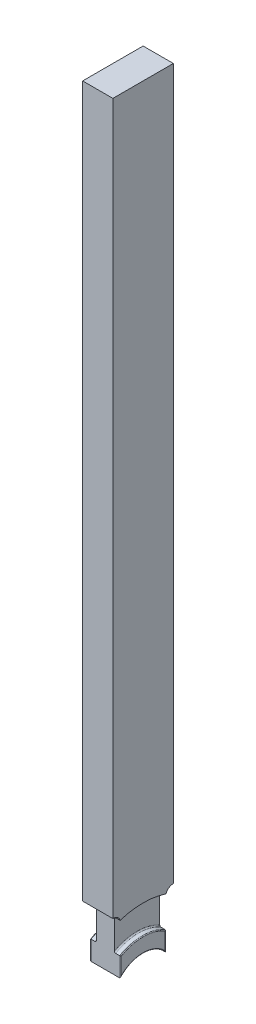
ISO-10303-21;
HEADER;
FILE_DESCRIPTION(('STEP AP214'),'2;1');
FILE_NAME('part.step','',(''),(''),'','','');
FILE_SCHEMA(('AUTOMOTIVE_DESIGN { 1 0 10303 214 1 1 1 1 }'));
ENDSEC;
DATA;
#1=APPLICATION_CONTEXT('core data for automotive mechanical design processes');
#2=APPLICATION_PROTOCOL_DEFINITION('international standard','automotive_design',2000,#1);
#3=PRODUCT_CONTEXT('',#1,'mechanical');
#4=PRODUCT('Part','Part','',(#3));
#5=PRODUCT_RELATED_PRODUCT_CATEGORY('part','',(#4));
#6=PRODUCT_DEFINITION_FORMATION('','',#4);
#7=PRODUCT_DEFINITION_CONTEXT('part definition',#1,'design');
#8=PRODUCT_DEFINITION('design','',#6,#7);
#9=PRODUCT_DEFINITION_SHAPE('','',#8);
#10=(LENGTH_UNIT() NAMED_UNIT(*) SI_UNIT(.MILLI.,.METRE.));
#11=(NAMED_UNIT(*) PLANE_ANGLE_UNIT() SI_UNIT($,.RADIAN.));
#12=(NAMED_UNIT(*) SI_UNIT($,.STERADIAN.) SOLID_ANGLE_UNIT());
#13=UNCERTAINTY_MEASURE_WITH_UNIT(LENGTH_MEASURE(1.E-05),#10,'distance_accuracy_value','');
#14=(GEOMETRIC_REPRESENTATION_CONTEXT(3) GLOBAL_UNCERTAINTY_ASSIGNED_CONTEXT((#13)) GLOBAL_UNIT_ASSIGNED_CONTEXT((#10,
#11,#12)) REPRESENTATION_CONTEXT('',''));
#15=CARTESIAN_POINT('',(0.,0.,0.));
#16=DIRECTION('',(0.,0.,1.));
#17=DIRECTION('',(1.,0.,0.));
#18=AXIS2_PLACEMENT_3D('',#15,#16,#17);
#19=CARTESIAN_POINT('',(5.,260.,10.));
#20=DIRECTION('',(0.,0.,-1.));
#21=DIRECTION('',(0.,1.,0.));
#22=AXIS2_PLACEMENT_3D('',#19,#20,#21);
#23=PLANE('',#22);
#24=DIRECTION('',(0.,-1.,0.));
#25=VECTOR('',#24,1.);
#26=CARTESIAN_POINT('',(-5.,260.,10.));
#27=LINE('',#26,#25);
#28=CARTESIAN_POINT('',(-5.,260.,10.));
#29=VERTEX_POINT('',#28);
#30=CARTESIAN_POINT('',(-5.00000000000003,25.,10.));
#31=VERTEX_POINT('',#30);
#32=EDGE_CURVE('E311',#29,#31,#27,.T.);
#33=ORIENTED_EDGE('',*,*,#32,.T.);
#34=DIRECTION('',(1.,0.,0.));
#35=VECTOR('',#34,1.);
#36=CARTESIAN_POINT('',(5.,25.,9.99999999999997));
#37=LINE('',#36,#35);
#38=CARTESIAN_POINT('',(5.00000000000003,25.,10.));
#39=VERTEX_POINT('',#38);
#40=EDGE_CURVE('E290',#31,#39,#37,.T.);
#41=ORIENTED_EDGE('',*,*,#40,.T.);
#42=DIRECTION('',(0.,-1.,0.));
#43=VECTOR('',#42,1.);
#44=CARTESIAN_POINT('',(5.,260.,10.));
#45=LINE('',#44,#43);
#46=CARTESIAN_POINT('',(5.,260.,10.));
#47=VERTEX_POINT('',#46);
#48=EDGE_CURVE('E302',#47,#39,#45,.T.);
#49=ORIENTED_EDGE('',*,*,#48,.F.);
#50=DIRECTION('',(-1.,0.,0.));
#51=VECTOR('',#50,1.);
#52=CARTESIAN_POINT('',(5.,260.,10.));
#53=LINE('',#52,#51);
#54=EDGE_CURVE('E317',#47,#29,#53,.T.);
#55=ORIENTED_EDGE('',*,*,#54,.T.);
#56=EDGE_LOOP('',(#33,#41,#49,#55));
#57=FACE_BOUND('',#56,.T.);
#58=ADVANCED_FACE('F37',(#57),#23,.F.);
#59=CARTESIAN_POINT('',(5.,260.,-10.));
#60=DIRECTION('',(0.,0.,1.));
#61=DIRECTION('',(0.,-1.,0.));
#62=AXIS2_PLACEMENT_3D('',#59,#60,#61);
#63=PLANE('',#62);
#64=DIRECTION('',(0.,1.,0.));
#65=VECTOR('',#64,1.);
#66=CARTESIAN_POINT('',(5.,260.,-10.));
#67=LINE('',#66,#65);
#68=CARTESIAN_POINT('',(5.00000000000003,25.,-10.));
#69=VERTEX_POINT('',#68);
#70=CARTESIAN_POINT('',(5.,260.,-10.));
#71=VERTEX_POINT('',#70);
#72=EDGE_CURVE('E306',#69,#71,#67,.T.);
#73=ORIENTED_EDGE('',*,*,#72,.F.);
#74=DIRECTION('',(-1.,0.,0.));
#75=VECTOR('',#74,1.);
#76=CARTESIAN_POINT('',(5.,25.,-10.));
#77=LINE('',#76,#75);
#78=CARTESIAN_POINT('',(-5.00000000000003,25.,-10.));
#79=VERTEX_POINT('',#78);
#80=EDGE_CURVE('E222',#69,#79,#77,.T.);
#81=ORIENTED_EDGE('',*,*,#80,.T.);
#82=DIRECTION('',(0.,1.,0.));
#83=VECTOR('',#82,1.);
#84=CARTESIAN_POINT('',(-5.,260.,-10.));
#85=LINE('',#84,#83);
#86=CARTESIAN_POINT('',(-5.,260.,-10.));
#87=VERTEX_POINT('',#86);
#88=EDGE_CURVE('E303',#79,#87,#85,.T.);
#89=ORIENTED_EDGE('',*,*,#88,.T.);
#90=DIRECTION('',(-1.,0.,0.));
#91=VECTOR('',#90,1.);
#92=CARTESIAN_POINT('',(5.,260.,-10.));
#93=LINE('',#92,#91);
#94=EDGE_CURVE('E308',#71,#87,#93,.T.);
#95=ORIENTED_EDGE('',*,*,#94,.F.);
#96=EDGE_LOOP('',(#73,#81,#89,#95));
#97=FACE_BOUND('',#96,.T.);
#98=ADVANCED_FACE('F478',(#97),#63,.F.);
#99=CARTESIAN_POINT('',(5.,0.,0.));
#100=DIRECTION('',(-1.,0.,0.));
#101=DIRECTION('',(0.,0.,1.));
#102=AXIS2_PLACEMENT_3D('',#99,#100,#101);
#103=PLANE('',#102);
#104=CARTESIAN_POINT('',(5.,0.,0.));
#105=DIRECTION('',(-1.,0.,0.));
#106=DIRECTION('',(0.,0.,1.));
#107=AXIS2_PLACEMENT_3D('',#104,#105,#106);
#108=CIRCLE('',#107,14.75);
#109=CARTESIAN_POINT('',(5.,12.8452325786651,-7.25));
#110=VERTEX_POINT('',#109);
#111=CARTESIAN_POINT('',(5.,12.8452325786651,7.25));
#112=VERTEX_POINT('',#111);
#113=EDGE_CURVE('E855',#110,#112,#108,.F.);
#114=ORIENTED_EDGE('',*,*,#113,.T.);
#115=DIRECTION('',(0.,1.,0.));
#116=VECTOR('',#115,1.);
#117=CARTESIAN_POINT('',(5.,0.,7.25));
#118=LINE('',#117,#116);
#119=CARTESIAN_POINT('',(5.,7.24568837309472,7.25));
#120=VERTEX_POINT('',#119);
#121=EDGE_CURVE('E857',#112,#120,#118,.F.);
#122=ORIENTED_EDGE('',*,*,#121,.T.);
#123=CARTESIAN_POINT('',(5.,0.,0.));
#124=DIRECTION('',(-1.,0.,0.));
#125=DIRECTION('',(0.,0.,1.));
#126=AXIS2_PLACEMENT_3D('',#123,#124,#125);
#127=CIRCLE('',#126,10.25);
#128=CARTESIAN_POINT('',(5.,7.24568837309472,-7.25));
#129=VERTEX_POINT('',#128);
#130=EDGE_CURVE('E931',#120,#129,#127,.T.);
#131=ORIENTED_EDGE('',*,*,#130,.T.);
#132=DIRECTION('',(0.,-1.,0.));
#133=VECTOR('',#132,1.);
#134=CARTESIAN_POINT('',(5.,0.,-7.25));
#135=LINE('',#134,#133);
#136=EDGE_CURVE('E859',#129,#110,#135,.F.);
#137=ORIENTED_EDGE('',*,*,#136,.T.);
#138=EDGE_LOOP('',(#114,#122,#131,#137));
#139=FACE_BOUND('',#138,.T.);
#140=ADVANCED_FACE('F483',(#139),#103,.F.);
#141=CARTESIAN_POINT('',(-5.,0.,0.));
#142=DIRECTION('',(-1.,0.,0.));
#143=DIRECTION('',(0.,0.,1.));
#144=AXIS2_PLACEMENT_3D('',#141,#142,#143);
#145=PLANE('',#144);
#146=CARTESIAN_POINT('',(-5.00000000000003,22.6124,-9.8876));
#147=DIRECTION('',(1.,0.,0.));
#148=DIRECTION('',(0.,0.,1.));
#149=AXIS2_PLACEMENT_3D('',#146,#147,#148);
#150=CIRCLE('',#149,2.3876);
#151=CARTESIAN_POINT('',(-5.00000000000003,25.,-9.8876));
#152=VERTEX_POINT('',#151);
#153=CARTESIAN_POINT('',(-5.00000000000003,23.2918345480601,-7.59871327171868));
#154=VERTEX_POINT('',#153);
#155=EDGE_CURVE('E234',#152,#154,#150,.T.);
#156=ORIENTED_EDGE('',*,*,#155,.T.);
#157=CARTESIAN_POINT('',(-5.00000000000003,0.,0.));
#158=DIRECTION('',(-1.,0.,0.));
#159=DIRECTION('',(0.,0.,1.));
#160=AXIS2_PLACEMENT_3D('',#157,#158,#159);
#161=CIRCLE('',#160,24.5);
#162=CARTESIAN_POINT('',(-5.00000000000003,23.2918345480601,7.59871327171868));
#163=VERTEX_POINT('',#162);
#164=EDGE_CURVE('E294',#163,#154,#161,.T.);
#165=ORIENTED_EDGE('',*,*,#164,.F.);
#166=CARTESIAN_POINT('',(-5.00000000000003,22.6124,9.8876));
#167=DIRECTION('',(1.,0.,0.));
#168=DIRECTION('',(0.,0.,-1.));
#169=AXIS2_PLACEMENT_3D('',#166,#167,#168);
#170=CIRCLE('',#169,2.3876);
#171=CARTESIAN_POINT('',(-5.00000000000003,25.,9.8876));
#172=VERTEX_POINT('',#171);
#173=EDGE_CURVE('E255',#163,#172,#170,.T.);
#174=ORIENTED_EDGE('',*,*,#173,.T.);
#175=DIRECTION('',(0.,0.,1.));
#176=VECTOR('',#175,1.);
#177=CARTESIAN_POINT('',(-5.00000000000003,25.,9.8876));
#178=LINE('',#177,#176);
#179=EDGE_CURVE('E258',#172,#31,#178,.T.);
#180=ORIENTED_EDGE('',*,*,#179,.T.);
#181=ORIENTED_EDGE('',*,*,#32,.F.);
#182=DIRECTION('',(0.,0.,1.));
#183=VECTOR('',#182,1.);
#184=CARTESIAN_POINT('',(-5.,260.,10.));
#185=LINE('',#184,#183);
#186=EDGE_CURVE('E296',#87,#29,#185,.T.);
#187=ORIENTED_EDGE('',*,*,#186,.F.);
#188=ORIENTED_EDGE('',*,*,#88,.F.);
#189=DIRECTION('',(0.,0.,1.));
#190=VECTOR('',#189,1.);
#191=CARTESIAN_POINT('',(-5.00000000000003,25.,-9.8876));
#192=LINE('',#191,#190);
#193=EDGE_CURVE('E243',#79,#152,#192,.T.);
#194=ORIENTED_EDGE('',*,*,#193,.T.);
#195=EDGE_LOOP('',(#156,#165,#174,#180,#181,#187,#188,#194));
#196=FACE_BOUND('',#195,.T.);
#197=ADVANCED_FACE('F487',(#196),#145,.T.);
#198=DIRECTION('',(0.,1.,0.));
#199=VECTOR('',#198,1.);
#200=CARTESIAN_POINT('',(-5.,12.9903810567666,7.25));
#201=LINE('',#200,#199);
#202=CARTESIAN_POINT('',(-5.,7.24568837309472,7.25));
#203=VERTEX_POINT('',#202);
#204=CARTESIAN_POINT('',(-5.,12.8452325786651,7.25));
#205=VERTEX_POINT('',#204);
#206=EDGE_CURVE('E59',#203,#205,#201,.T.);
#207=ORIENTED_EDGE('',*,*,#206,.T.);
#208=CARTESIAN_POINT('',(-5.,0.,0.));
#209=DIRECTION('',(-1.,0.,0.));
#210=DIRECTION('',(0.,0.,1.));
#211=AXIS2_PLACEMENT_3D('',#208,#209,#210);
#212=CIRCLE('',#211,14.75);
#213=CARTESIAN_POINT('',(-5.,12.8452325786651,-7.25));
#214=VERTEX_POINT('',#213);
#215=EDGE_CURVE('E51',#205,#214,#212,.T.);
#216=ORIENTED_EDGE('',*,*,#215,.T.);
#217=DIRECTION('',(0.,-1.,0.));
#218=VECTOR('',#217,1.);
#219=CARTESIAN_POINT('',(-5.,6.61437827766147,-7.25));
#220=LINE('',#219,#218);
#221=CARTESIAN_POINT('',(-5.,7.24568837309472,-7.25));
#222=VERTEX_POINT('',#221);
#223=EDGE_CURVE('E945',#214,#222,#220,.T.);
#224=ORIENTED_EDGE('',*,*,#223,.T.);
#225=CARTESIAN_POINT('',(-5.,0.,0.));
#226=DIRECTION('',(-1.,0.,0.));
#227=DIRECTION('',(0.,0.,1.));
#228=AXIS2_PLACEMENT_3D('',#225,#226,#227);
#229=CIRCLE('',#228,10.25);
#230=EDGE_CURVE('E64',#222,#203,#229,.F.);
#231=ORIENTED_EDGE('',*,*,#230,.T.);
#232=EDGE_LOOP('',(#207,#216,#224,#231));
#233=FACE_BOUND('',#232,.T.);
#234=ADVANCED_FACE('F490',(#233),#145,.T.);
#235=CARTESIAN_POINT('',(5.,260.,10.));
#236=DIRECTION('',(0.,-1.,0.));
#237=DIRECTION('',(0.,0.,-1.));
#238=AXIS2_PLACEMENT_3D('',#235,#236,#237);
#239=PLANE('',#238);
#240=ORIENTED_EDGE('',*,*,#186,.T.);
#241=ORIENTED_EDGE('',*,*,#54,.F.);
#242=DIRECTION('',(0.,0.,1.));
#243=VECTOR('',#242,1.);
#244=CARTESIAN_POINT('',(5.,260.,10.));
#245=LINE('',#244,#243);
#246=EDGE_CURVE('E299',#71,#47,#245,.T.);
#247=ORIENTED_EDGE('',*,*,#246,.F.);
#248=ORIENTED_EDGE('',*,*,#94,.T.);
#249=EDGE_LOOP('',(#240,#241,#247,#248));
#250=FACE_BOUND('',#249,.T.);
#251=ADVANCED_FACE('F367',(#250),#239,.F.);
#252=CARTESIAN_POINT('',(5.00000000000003,0.,0.));
#253=DIRECTION('',(-1.,0.,0.));
#254=DIRECTION('',(0.,0.,1.));
#255=AXIS2_PLACEMENT_3D('',#252,#253,#254);
#256=CIRCLE('',#255,24.5);
#257=CARTESIAN_POINT('',(5.00000000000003,23.2918345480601,7.59871327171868));
#258=VERTEX_POINT('',#257);
#259=CARTESIAN_POINT('',(5.00000000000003,23.2918345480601,-7.59871327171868));
#260=VERTEX_POINT('',#259);
#261=EDGE_CURVE('E242',#258,#260,#256,.T.);
#262=ORIENTED_EDGE('',*,*,#261,.T.);
#263=CARTESIAN_POINT('',(5.00000000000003,22.6124,-9.8876));
#264=DIRECTION('',(1.,0.,0.));
#265=DIRECTION('',(0.,0.,1.));
#266=AXIS2_PLACEMENT_3D('',#263,#264,#265);
#267=CIRCLE('',#266,2.3876);
#268=CARTESIAN_POINT('',(5.00000000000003,25.,-9.8876));
#269=VERTEX_POINT('',#268);
#270=EDGE_CURVE('E226',#269,#260,#267,.T.);
#271=ORIENTED_EDGE('',*,*,#270,.F.);
#272=DIRECTION('',(0.,0.,1.));
#273=VECTOR('',#272,1.);
#274=CARTESIAN_POINT('',(5.00000000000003,25.,-9.8876));
#275=LINE('',#274,#273);
#276=EDGE_CURVE('E216',#69,#269,#275,.T.);
#277=ORIENTED_EDGE('',*,*,#276,.F.);
#278=ORIENTED_EDGE('',*,*,#72,.T.);
#279=ORIENTED_EDGE('',*,*,#246,.T.);
#280=ORIENTED_EDGE('',*,*,#48,.T.);
#281=DIRECTION('',(0.,0.,1.));
#282=VECTOR('',#281,1.);
#283=CARTESIAN_POINT('',(5.00000000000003,25.,9.8876));
#284=LINE('',#283,#282);
#285=CARTESIAN_POINT('',(5.00000000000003,25.,9.8876));
#286=VERTEX_POINT('',#285);
#287=EDGE_CURVE('E252',#286,#39,#284,.T.);
#288=ORIENTED_EDGE('',*,*,#287,.F.);
#289=CARTESIAN_POINT('',(5.00000000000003,22.6124,9.8876));
#290=DIRECTION('',(1.,0.,0.));
#291=DIRECTION('',(0.,0.,-1.));
#292=AXIS2_PLACEMENT_3D('',#289,#290,#291);
#293=CIRCLE('',#292,2.3876);
#294=EDGE_CURVE('E250',#258,#286,#293,.T.);
#295=ORIENTED_EDGE('',*,*,#294,.F.);
#296=EDGE_LOOP('',(#262,#271,#277,#278,#279,#280,#288,#295));
#297=FACE_BOUND('',#296,.T.);
#298=ADVANCED_FACE('F239',(#297),#103,.F.);
#299=CARTESIAN_POINT('',(-5.,0.,0.));
#300=DIRECTION('',(1.,0.,0.));
#301=DIRECTION('',(0.,0.,-1.));
#302=AXIS2_PLACEMENT_3D('',#299,#300,#301);
#303=CYLINDRICAL_SURFACE('',#302,10.);
#304=DIRECTION('',(1.,0.,0.));
#305=VECTOR('',#304,1.);
#306=CARTESIAN_POINT('',(-5.,6.61437827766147,-7.5));
#307=LINE('',#306,#305);
#308=CARTESIAN_POINT('',(-4.75,6.61437827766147,-7.5));
#309=VERTEX_POINT('',#308);
#310=CARTESIAN_POINT('',(4.75,6.61437827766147,-7.5));
#311=VERTEX_POINT('',#310);
#312=EDGE_CURVE('E287',#309,#311,#307,.T.);
#313=ORIENTED_EDGE('',*,*,#312,.T.);
#314=CARTESIAN_POINT('',(4.75,0.,0.));
#315=DIRECTION('',(-1.,0.,0.));
#316=DIRECTION('',(0.,0.,1.));
#317=AXIS2_PLACEMENT_3D('',#314,#315,#316);
#318=CIRCLE('',#317,10.);
#319=CARTESIAN_POINT('',(4.75,6.61437827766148,7.5));
#320=VERTEX_POINT('',#319);
#321=EDGE_CURVE('E943',#311,#320,#318,.F.);
#322=ORIENTED_EDGE('',*,*,#321,.T.);
#323=DIRECTION('',(1.,0.,0.));
#324=VECTOR('',#323,1.);
#325=CARTESIAN_POINT('',(-5.,6.61437827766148,7.5));
#326=LINE('',#325,#324);
#327=CARTESIAN_POINT('',(-4.75,6.61437827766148,7.5));
#328=VERTEX_POINT('',#327);
#329=EDGE_CURVE('E277',#320,#328,#326,.F.);
#330=ORIENTED_EDGE('',*,*,#329,.T.);
#331=CARTESIAN_POINT('',(-4.75,0.,0.));
#332=DIRECTION('',(-1.,0.,0.));
#333=DIRECTION('',(0.,0.,1.));
#334=AXIS2_PLACEMENT_3D('',#331,#332,#333);
#335=CIRCLE('',#334,10.);
#336=EDGE_CURVE('E941',#328,#309,#335,.T.);
#337=ORIENTED_EDGE('',*,*,#336,.T.);
#338=EDGE_LOOP('',(#313,#322,#330,#337));
#339=FACE_BOUND('',#338,.T.);
#340=ADVANCED_FACE('F494',(#339),#303,.F.);
#341=CARTESIAN_POINT('',(-3.,15.,0.));
#342=DIRECTION('',(-1.,0.,0.));
#343=DIRECTION('',(0.,0.,1.));
#344=AXIS2_PLACEMENT_3D('',#341,#342,#343);
#345=PLANE('',#344);
#346=DIRECTION('',(0.,1.,0.));
#347=VECTOR('',#346,1.);
#348=CARTESIAN_POINT('',(-3.,15.,-7.5));
#349=LINE('',#348,#347);
#350=CARTESIAN_POINT('',(-3.,13.428520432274,-7.5));
#351=VERTEX_POINT('',#350);
#352=CARTESIAN_POINT('',(-3.,22.5220479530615,-7.5));
#353=VERTEX_POINT('',#352);
#354=EDGE_CURVE('E285',#351,#353,#349,.T.);
#355=ORIENTED_EDGE('',*,*,#354,.F.);
#356=CARTESIAN_POINT('',(-3.,0.,0.));
#357=DIRECTION('',(-1.,0.,0.));
#358=DIRECTION('',(0.,0.,1.));
#359=AXIS2_PLACEMENT_3D('',#356,#357,#358);
#360=CIRCLE('',#359,15.381);
#361=CARTESIAN_POINT('',(-3.,13.428520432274,7.5));
#362=VERTEX_POINT('',#361);
#363=EDGE_CURVE('E416',#351,#362,#360,.F.);
#364=ORIENTED_EDGE('',*,*,#363,.T.);
#365=DIRECTION('',(0.,-1.,0.));
#366=VECTOR('',#365,1.);
#367=CARTESIAN_POINT('',(-3.,15.,7.5));
#368=LINE('',#367,#366);
#369=CARTESIAN_POINT('',(-3.,22.5220479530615,7.5));
#370=VERTEX_POINT('',#369);
#371=EDGE_CURVE('E274',#370,#362,#368,.T.);
#372=ORIENTED_EDGE('',*,*,#371,.F.);
#373=CARTESIAN_POINT('',(-3.,0.,0.));
#374=DIRECTION('',(-1.,0.,0.));
#375=DIRECTION('',(0.,0.,1.));
#376=AXIS2_PLACEMENT_3D('',#373,#374,#375);
#377=CIRCLE('',#376,23.738);
#378=EDGE_CURVE('E329',#370,#353,#377,.T.);
#379=ORIENTED_EDGE('',*,*,#378,.T.);
#380=EDGE_LOOP('',(#355,#364,#372,#379));
#381=FACE_BOUND('',#380,.T.);
#382=ADVANCED_FACE('F497',(#381),#345,.T.);
#383=CARTESIAN_POINT('',(-8.84822894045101,0.,0.));
#384=DIRECTION('',(-1.,0.,0.));
#385=DIRECTION('',(0.,0.,1.));
#386=AXIS2_PLACEMENT_3D('',#383,#384,#385);
#387=CYLINDRICAL_SURFACE('',#386,24.5);
#388=DIRECTION('',(1.,0.,0.));
#389=VECTOR('',#388,1.);
#390=CARTESIAN_POINT('',(-4.00000000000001,23.2918345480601,-7.59871327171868));
#391=LINE('',#390,#389);
#392=CARTESIAN_POINT('',(-3.762,23.2918345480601,-7.59871327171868));
#393=VERTEX_POINT('',#392);
#394=EDGE_CURVE('E267',#393,#154,#391,.F.);
#395=ORIENTED_EDGE('',*,*,#394,.F.);
#396=CARTESIAN_POINT('',(-3.762,0.,0.));
#397=DIRECTION('',(-1.,0.,0.));
#398=DIRECTION('',(0.,0.,1.));
#399=AXIS2_PLACEMENT_3D('',#396,#397,#398);
#400=CIRCLE('',#399,24.5);
#401=CARTESIAN_POINT('',(-3.762,23.2918345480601,7.59871327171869));
#402=VERTEX_POINT('',#401);
#403=EDGE_CURVE('E332',#393,#402,#400,.F.);
#404=ORIENTED_EDGE('',*,*,#403,.T.);
#405=DIRECTION('',(1.,0.,0.));
#406=VECTOR('',#405,1.);
#407=CARTESIAN_POINT('',(-4.00000000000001,23.2918345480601,7.59871327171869));
#408=LINE('',#407,#406);
#409=EDGE_CURVE('E248',#163,#402,#408,.T.);
#410=ORIENTED_EDGE('',*,*,#409,.F.);
#411=ORIENTED_EDGE('',*,*,#164,.T.);
#412=EDGE_LOOP('',(#395,#404,#410,#411));
#413=FACE_BOUND('',#412,.T.);
#414=ADVANCED_FACE('F499',(#413),#387,.F.);
#415=CARTESIAN_POINT('',(-8.84822894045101,0.,0.));
#416=DIRECTION('',(-1.,0.,0.));
#417=DIRECTION('',(0.,0.,1.));
#418=AXIS2_PLACEMENT_3D('',#415,#416,#417);
#419=CYLINDRICAL_SURFACE('',#418,15.);
#420=DIRECTION('',(-1.,0.,0.));
#421=VECTOR('',#420,1.);
#422=CARTESIAN_POINT('',(-8.84822894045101,12.9903810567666,-7.5));
#423=LINE('',#422,#421);
#424=CARTESIAN_POINT('',(-4.75,12.9903810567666,-7.5));
#425=VERTEX_POINT('',#424);
#426=CARTESIAN_POINT('',(-3.381,12.9903810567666,-7.5));
#427=VERTEX_POINT('',#426);
#428=EDGE_CURVE('E283',#425,#427,#423,.F.);
#429=ORIENTED_EDGE('',*,*,#428,.F.);
#430=CARTESIAN_POINT('',(-4.75,0.,0.));
#431=DIRECTION('',(-1.,0.,0.));
#432=DIRECTION('',(0.,0.,1.));
#433=AXIS2_PLACEMENT_3D('',#430,#431,#432);
#434=CIRCLE('',#433,15.);
#435=CARTESIAN_POINT('',(-4.75,12.9903810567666,7.5));
#436=VERTEX_POINT('',#435);
#437=EDGE_CURVE('E11',#425,#436,#434,.F.);
#438=ORIENTED_EDGE('',*,*,#437,.T.);
#439=DIRECTION('',(-1.,0.,0.));
#440=VECTOR('',#439,1.);
#441=CARTESIAN_POINT('',(-8.84822894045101,12.9903810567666,7.5));
#442=LINE('',#441,#440);
#443=CARTESIAN_POINT('',(-3.381,12.9903810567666,7.5));
#444=VERTEX_POINT('',#443);
#445=EDGE_CURVE('E271',#444,#436,#442,.T.);
#446=ORIENTED_EDGE('',*,*,#445,.F.);
#447=CARTESIAN_POINT('',(-3.381,0.,0.));
#448=DIRECTION('',(-1.,0.,0.));
#449=DIRECTION('',(0.,0.,1.));
#450=AXIS2_PLACEMENT_3D('',#447,#448,#449);
#451=CIRCLE('',#450,15.);
#452=EDGE_CURVE('E407',#444,#427,#451,.T.);
#453=ORIENTED_EDGE('',*,*,#452,.T.);
#454=EDGE_LOOP('',(#429,#438,#446,#453));
#455=FACE_BOUND('',#454,.T.);
#456=ADVANCED_FACE('F502',(#455),#419,.T.);
#457=CARTESIAN_POINT('',(3.,15.,0.));
#458=DIRECTION('',(1.,0.,0.));
#459=DIRECTION('',(0.,0.,-1.));
#460=AXIS2_PLACEMENT_3D('',#457,#458,#459);
#461=PLANE('',#460);
#462=DIRECTION('',(0.,1.,0.));
#463=VECTOR('',#462,1.);
#464=CARTESIAN_POINT('',(3.,15.,7.5));
#465=LINE('',#464,#463);
#466=CARTESIAN_POINT('',(3.,13.428520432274,7.5));
#467=VERTEX_POINT('',#466);
#468=CARTESIAN_POINT('',(3.,22.5220479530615,7.5));
#469=VERTEX_POINT('',#468);
#470=EDGE_CURVE('E269',#467,#469,#465,.T.);
#471=ORIENTED_EDGE('',*,*,#470,.F.);
#472=CARTESIAN_POINT('',(3.,0.,0.));
#473=DIRECTION('',(1.,0.,0.));
#474=DIRECTION('',(0.,0.,-1.));
#475=AXIS2_PLACEMENT_3D('',#472,#473,#474);
#476=CIRCLE('',#475,15.381);
#477=CARTESIAN_POINT('',(3.,13.428520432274,-7.5));
#478=VERTEX_POINT('',#477);
#479=EDGE_CURVE('E418',#467,#478,#476,.F.);
#480=ORIENTED_EDGE('',*,*,#479,.T.);
#481=DIRECTION('',(0.,-1.,0.));
#482=VECTOR('',#481,1.);
#483=CARTESIAN_POINT('',(3.,15.,-7.5));
#484=LINE('',#483,#482);
#485=CARTESIAN_POINT('',(3.,22.5220479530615,-7.5));
#486=VERTEX_POINT('',#485);
#487=EDGE_CURVE('E280',#486,#478,#484,.T.);
#488=ORIENTED_EDGE('',*,*,#487,.F.);
#489=CARTESIAN_POINT('',(3.,0.,0.));
#490=DIRECTION('',(1.,0.,0.));
#491=DIRECTION('',(0.,0.,-1.));
#492=AXIS2_PLACEMENT_3D('',#489,#490,#491);
#493=CIRCLE('',#492,23.738);
#494=EDGE_CURVE('E337',#486,#469,#493,.T.);
#495=ORIENTED_EDGE('',*,*,#494,.T.);
#496=EDGE_LOOP('',(#471,#480,#488,#495));
#497=FACE_BOUND('',#496,.T.);
#498=ADVANCED_FACE('F506',(#497),#461,.T.);
#499=CARTESIAN_POINT('',(-8.84822894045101,0.,0.));
#500=DIRECTION('',(-1.,0.,0.));
#501=DIRECTION('',(0.,0.,1.));
#502=AXIS2_PLACEMENT_3D('',#499,#500,#501);
#503=CYLINDRICAL_SURFACE('',#502,15.);
#504=DIRECTION('',(-1.,0.,0.));
#505=VECTOR('',#504,1.);
#506=CARTESIAN_POINT('',(-8.84822894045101,12.9903810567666,7.5));
#507=LINE('',#506,#505);
#508=CARTESIAN_POINT('',(4.75,12.9903810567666,7.5));
#509=VERTEX_POINT('',#508);
#510=CARTESIAN_POINT('',(3.381,12.9903810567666,7.5));
#511=VERTEX_POINT('',#510);
#512=EDGE_CURVE('E324',#509,#511,#507,.T.);
#513=ORIENTED_EDGE('',*,*,#512,.F.);
#514=CARTESIAN_POINT('',(4.75,0.,0.));
#515=DIRECTION('',(-1.,0.,0.));
#516=DIRECTION('',(0.,0.,1.));
#517=AXIS2_PLACEMENT_3D('',#514,#515,#516);
#518=CIRCLE('',#517,15.);
#519=CARTESIAN_POINT('',(4.75,12.9903810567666,-7.5));
#520=VERTEX_POINT('',#519);
#521=EDGE_CURVE('E870',#509,#520,#518,.T.);
#522=ORIENTED_EDGE('',*,*,#521,.T.);
#523=DIRECTION('',(-1.,0.,0.));
#524=VECTOR('',#523,1.);
#525=CARTESIAN_POINT('',(-8.84822894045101,12.9903810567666,-7.5));
#526=LINE('',#525,#524);
#527=CARTESIAN_POINT('',(3.381,12.9903810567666,-7.5));
#528=VERTEX_POINT('',#527);
#529=EDGE_CURVE('E326',#528,#520,#526,.F.);
#530=ORIENTED_EDGE('',*,*,#529,.F.);
#531=CARTESIAN_POINT('',(3.381,0.,0.));
#532=DIRECTION('',(1.,0.,0.));
#533=DIRECTION('',(0.,0.,-1.));
#534=AXIS2_PLACEMENT_3D('',#531,#532,#533);
#535=CIRCLE('',#534,15.);
#536=EDGE_CURVE('E421',#528,#511,#535,.T.);
#537=ORIENTED_EDGE('',*,*,#536,.T.);
#538=EDGE_LOOP('',(#513,#522,#530,#537));
#539=FACE_BOUND('',#538,.T.);
#540=ADVANCED_FACE('F511',(#539),#503,.T.);
#541=CARTESIAN_POINT('',(-8.84822894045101,0.,0.));
#542=DIRECTION('',(-1.,0.,0.));
#543=DIRECTION('',(0.,0.,1.));
#544=AXIS2_PLACEMENT_3D('',#541,#542,#543);
#545=CYLINDRICAL_SURFACE('',#544,24.5);
#546=DIRECTION('',(1.,0.,0.));
#547=VECTOR('',#546,1.);
#548=CARTESIAN_POINT('',(4.00000000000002,23.2918345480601,7.59871327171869));
#549=LINE('',#548,#547);
#550=CARTESIAN_POINT('',(3.762,23.2918345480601,7.59871327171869));
#551=VERTEX_POINT('',#550);
#552=EDGE_CURVE('E320',#551,#258,#549,.T.);
#553=ORIENTED_EDGE('',*,*,#552,.F.);
#554=CARTESIAN_POINT('',(3.762,0.,0.));
#555=DIRECTION('',(1.,0.,0.));
#556=DIRECTION('',(0.,0.,-1.));
#557=AXIS2_PLACEMENT_3D('',#554,#555,#556);
#558=CIRCLE('',#557,24.5);
#559=CARTESIAN_POINT('',(3.762,23.2918345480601,-7.59871327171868));
#560=VERTEX_POINT('',#559);
#561=EDGE_CURVE('E334',#551,#560,#558,.F.);
#562=ORIENTED_EDGE('',*,*,#561,.T.);
#563=DIRECTION('',(1.,0.,0.));
#564=VECTOR('',#563,1.);
#565=CARTESIAN_POINT('',(4.00000000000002,23.2918345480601,-7.59871327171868));
#566=LINE('',#565,#564);
#567=EDGE_CURVE('E322',#260,#560,#566,.F.);
#568=ORIENTED_EDGE('',*,*,#567,.F.);
#569=ORIENTED_EDGE('',*,*,#261,.F.);
#570=EDGE_LOOP('',(#553,#562,#568,#569));
#571=FACE_BOUND('',#570,.T.);
#572=ADVANCED_FACE('F396',(#571),#545,.F.);
#573=CARTESIAN_POINT('',(-5.00000000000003,25.,9.8876));
#574=DIRECTION('',(0.,1.,0.));
#575=DIRECTION('',(0.,0.,1.));
#576=AXIS2_PLACEMENT_3D('',#573,#574,#575);
#577=PLANE('',#576);
#578=ORIENTED_EDGE('',*,*,#179,.F.);
#579=DIRECTION('',(1.,0.,0.));
#580=VECTOR('',#579,1.);
#581=CARTESIAN_POINT('',(-5.00000000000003,25.,9.8876));
#582=LINE('',#581,#580);
#583=EDGE_CURVE('E261',#172,#286,#582,.T.);
#584=ORIENTED_EDGE('',*,*,#583,.T.);
#585=ORIENTED_EDGE('',*,*,#287,.T.);
#586=ORIENTED_EDGE('',*,*,#40,.F.);
#587=EDGE_LOOP('',(#578,#584,#585,#586));
#588=FACE_BOUND('',#587,.T.);
#589=ADVANCED_FACE('F395',(#588),#577,.F.);
#590=CARTESIAN_POINT('',(-5.00000000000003,0.,7.5));
#591=DIRECTION('',(0.,0.,-1.));
#592=DIRECTION('',(0.,1.,0.));
#593=AXIS2_PLACEMENT_3D('',#590,#591,#592);
#594=PLANE('',#593);
#595=ORIENTED_EDGE('',*,*,#329,.F.);
#596=DIRECTION('',(0.,1.,0.));
#597=VECTOR('',#596,1.);
#598=CARTESIAN_POINT('',(4.75,0.,7.5));
#599=LINE('',#598,#597);
#600=EDGE_CURVE('E930',#320,#509,#599,.T.);
#601=ORIENTED_EDGE('',*,*,#600,.T.);
#602=ORIENTED_EDGE('',*,*,#512,.T.);
#603=CARTESIAN_POINT('',(3.381,12.9903810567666,7.5));
#604=CARTESIAN_POINT('',(3.36159348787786,12.9903515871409,7.5));
#605=CARTESIAN_POINT('',(3.34220939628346,12.9920910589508,7.5));
#606=CARTESIAN_POINT('',(3.30411089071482,12.9988686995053,7.5));
#607=CARTESIAN_POINT('',(3.28539391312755,13.0038923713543,7.5));
#608=CARTESIAN_POINT('',(3.24909102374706,13.0169971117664,7.5));
#609=CARTESIAN_POINT('',(3.23150411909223,13.0250754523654,7.5));
#610=CARTESIAN_POINT('',(3.19783116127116,13.0439266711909,7.5));
#611=CARTESIAN_POINT('',(3.18174642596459,13.054701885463,7.5));
#612=CARTESIAN_POINT('',(3.15058262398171,13.0791681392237,7.5));
#613=CARTESIAN_POINT('',(3.1356009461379,13.0929827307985,7.5));
#614=CARTESIAN_POINT('',(3.10785285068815,13.1226713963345,7.5));
#615=CARTESIAN_POINT('',(3.09508691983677,13.1385459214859,7.5));
#616=CARTESIAN_POINT('',(3.07041818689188,13.174041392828,7.5));
#617=CARTESIAN_POINT('',(3.05883169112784,13.1938820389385,7.5));
#618=CARTESIAN_POINT('',(3.03871875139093,13.235070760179,7.5));
#619=CARTESIAN_POINT('',(3.03019562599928,13.2564204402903,7.5));
#620=CARTESIAN_POINT('',(3.01549657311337,13.3025258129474,7.5));
#621=CARTESIAN_POINT('',(3.00968374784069,13.327397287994,7.5));
#622=CARTESIAN_POINT('',(3.00193752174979,13.3776913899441,7.5));
#623=CARTESIAN_POINT('',(2.99999691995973,13.4031129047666,7.5));
#624=CARTESIAN_POINT('',(3.,13.428520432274,7.5));
#625=B_SPLINE_CURVE_WITH_KNOTS('',3,(#603,#604,#605,#606,#607,#608,#609,#610,#611,#612,#613,
#614,#615,#616,#617,#618,#619,#620,#621,#622,#623,#624),.UNSPECIFIED.,.F.,.F.,(4,2,2,2,2,2,2,2,
2,2,4),(0.,0.0581065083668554,0.115958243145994,0.173758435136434,0.231608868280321,
0.292501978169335,0.35340844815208,0.422061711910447,0.490789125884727,0.567105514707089,
0.643279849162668),.UNSPECIFIED.);
#626=EDGE_CURVE('E458',#511,#467,#625,.T.);
#627=ORIENTED_EDGE('',*,*,#626,.T.);
#628=ORIENTED_EDGE('',*,*,#470,.T.);
#629=CARTESIAN_POINT('',(3.,22.5220479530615,7.5));
#630=CARTESIAN_POINT('',(3.00000022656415,22.5371498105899,7.5));
#631=CARTESIAN_POINT('',(3.0004036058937,22.5522300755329,7.5));
#632=CARTESIAN_POINT('',(3.00201667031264,22.5823474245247,7.5));
#633=CARTESIAN_POINT('',(3.003226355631,22.5973845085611,7.5));
#634=CARTESIAN_POINT('',(3.00483919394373,22.6124,7.5));
#635=B_SPLINE_CURVE_WITH_KNOTS('',3,(#629,#630,#631,#632,#633,#634),.UNSPECIFIED.,.F.,.F.,(4,2,
4),(0.,0.045256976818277,0.0905139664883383),.UNSPECIFIED.);
#636=CARTESIAN_POINT('',(3.00483919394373,22.6124,7.5));
#637=VERTEX_POINT('',#636);
#638=EDGE_CURVE('E408',#469,#637,#635,.T.);
#639=ORIENTED_EDGE('',*,*,#638,.T.);
#640=DIRECTION('',(1.,0.,0.));
#641=VECTOR('',#640,1.);
#642=CARTESIAN_POINT('',(-5.00000000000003,22.6124,7.5));
#643=LINE('',#642,#641);
#644=CARTESIAN_POINT('',(-3.00483919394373,22.6124,7.5));
#645=VERTEX_POINT('',#644);
#646=EDGE_CURVE('E227',#645,#637,#643,.T.);
#647=ORIENTED_EDGE('',*,*,#646,.F.);
#648=CARTESIAN_POINT('',(-3.00483919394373,22.6124,7.5));
#649=CARTESIAN_POINT('',(-3.003226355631,22.5973845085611,7.5));
#650=CARTESIAN_POINT('',(-3.00201667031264,22.5823474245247,7.5));
#651=CARTESIAN_POINT('',(-3.0004036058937,22.5522300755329,7.5));
#652=CARTESIAN_POINT('',(-3.00000022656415,22.5371498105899,7.5));
#653=CARTESIAN_POINT('',(-3.,22.5220479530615,7.5));
#654=B_SPLINE_CURVE_WITH_KNOTS('',3,(#648,#649,#650,#651,#652,#653),.UNSPECIFIED.,.F.,.F.,(4,2,
4),(0.,0.0452569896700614,0.0905139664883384),.UNSPECIFIED.);
#655=EDGE_CURVE('E382',#645,#370,#654,.T.);
#656=ORIENTED_EDGE('',*,*,#655,.T.);
#657=ORIENTED_EDGE('',*,*,#371,.T.);
#658=CARTESIAN_POINT('',(-3.,13.428520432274,7.5));
#659=CARTESIAN_POINT('',(-2.99998773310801,13.3960473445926,7.5));
#660=CARTESIAN_POINT('',(-3.00316588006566,13.3635248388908,7.5));
#661=CARTESIAN_POINT('',(-3.01585357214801,13.2995632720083,7.5));
#662=CARTESIAN_POINT('',(-3.02539701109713,13.2681309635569,7.5));
#663=CARTESIAN_POINT('',(-3.04884901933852,13.2124568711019,7.5));
#664=CARTESIAN_POINT('',(-3.06188078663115,13.1878460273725,7.5));
#665=CARTESIAN_POINT('',(-3.09231245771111,13.1415402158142,7.5));
#666=CARTESIAN_POINT('',(-3.10970093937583,13.1198378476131,7.5));
#667=CARTESIAN_POINT('',(-3.14655915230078,13.0824144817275,7.5));
#668=CARTESIAN_POINT('',(-3.16563766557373,13.0663097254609,7.5));
#669=CARTESIAN_POINT('',(-3.20659393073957,13.0381967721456,7.5));
#670=CARTESIAN_POINT('',(-3.22846666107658,13.0261813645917,7.5));
#671=CARTESIAN_POINT('',(-3.27177499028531,13.0081040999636,7.5));
#672=CARTESIAN_POINT('',(-3.2929987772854,13.0015363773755,7.5));
#673=CARTESIAN_POINT('',(-3.33646159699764,12.9926369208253,7.5));
#674=CARTESIAN_POINT('',(-3.35870658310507,12.9903344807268,7.5));
#675=CARTESIAN_POINT('',(-3.381,12.9903810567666,7.5));
#676=B_SPLINE_CURVE_WITH_KNOTS('',3,(#658,#659,#660,#661,#662,#663,#664,#665,#666,#667,#668,
#669,#670,#671,#672,#673,#674,#675),.UNSPECIFIED.,.F.,.F.,(4,2,2,2,2,2,2,2,4),(0.,
0.0973546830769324,0.195231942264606,0.278328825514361,0.361210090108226,0.435666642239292,
0.509991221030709,0.576221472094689,0.642904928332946),.UNSPECIFIED.);
#677=EDGE_CURVE('E430',#362,#444,#676,.T.);
#678=ORIENTED_EDGE('',*,*,#677,.T.);
#679=ORIENTED_EDGE('',*,*,#445,.T.);
#680=DIRECTION('',(0.,1.,0.));
#681=VECTOR('',#680,1.);
#682=CARTESIAN_POINT('',(-4.75,6.61437827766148,7.5));
#683=LINE('',#682,#681);
#684=EDGE_CURVE('E464',#436,#328,#683,.F.);
#685=ORIENTED_EDGE('',*,*,#684,.T.);
#686=EDGE_LOOP('',(#595,#601,#602,#627,#628,#639,#647,#656,#657,#678,#679,#685));
#687=FACE_BOUND('',#686,.T.);
#688=ADVANCED_FACE('F393',(#687),#594,.F.);
#689=CARTESIAN_POINT('',(-5.00000000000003,22.6124,9.8876));
#690=DIRECTION('',(1.,0.,0.));
#691=DIRECTION('',(0.,0.,-1.));
#692=AXIS2_PLACEMENT_3D('',#689,#690,#691);
#693=CYLINDRICAL_SURFACE('',#692,2.3876);
#694=ORIENTED_EDGE('',*,*,#409,.T.);
#695=CARTESIAN_POINT('',(-3.762,23.2918345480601,7.59871327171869));
#696=CARTESIAN_POINT('',(-3.71922808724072,23.2918594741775,7.59875477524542));
#697=CARTESIAN_POINT('',(-3.67646565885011,23.2883828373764,7.59768925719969));
#698=CARTESIAN_POINT('',(-3.59216566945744,23.2746068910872,7.59364956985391));
#699=CARTESIAN_POINT('',(-3.55062755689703,23.2643107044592,7.59067627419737));
#700=CARTESIAN_POINT('',(-3.46991739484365,23.2370679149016,7.58312371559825));
#701=CARTESIAN_POINT('',(-3.43074673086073,23.2201174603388,7.57854352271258));
#702=CARTESIAN_POINT('',(-3.35593083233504,23.1799381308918,7.56834044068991));
#703=CARTESIAN_POINT('',(-3.32028456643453,23.1567111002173,7.56271785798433));
#704=CARTESIAN_POINT('',(-3.25372127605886,23.1046516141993,7.55114404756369));
#705=CARTESIAN_POINT('',(-3.22278007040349,23.0758496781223,7.54519473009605));
#706=CARTESIAN_POINT('',(-3.16628996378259,23.0132927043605,7.53368252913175));
#707=CARTESIAN_POINT('',(-3.14074149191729,22.9795372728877,7.52811967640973));
#708=CARTESIAN_POINT('',(-3.09610184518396,22.9086206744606,7.51818070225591));
#709=CARTESIAN_POINT('',(-3.07691336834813,22.8715230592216,7.51378692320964));
#710=CARTESIAN_POINT('',(-3.04484920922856,22.794565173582,7.50664707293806));
#711=CARTESIAN_POINT('',(-3.03196803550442,22.7547073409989,7.50389956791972));
#712=CARTESIAN_POINT('',(-3.01830076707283,22.6973409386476,7.50145187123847));
#713=CARTESIAN_POINT('',(-3.01485478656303,22.6804589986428,7.50090969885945));
#714=CARTESIAN_POINT('',(-3.00904449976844,22.6465389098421,7.50018403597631));
#715=CARTESIAN_POINT('',(-3.00667792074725,22.6295011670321,7.49999978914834));
#716=CARTESIAN_POINT('',(-3.00483919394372,22.6124,7.5));
#717=B_SPLINE_CURVE_WITH_KNOTS('',3,(#695,#696,#697,#698,#699,#700,#701,#702,#703,#704,#705,
#706,#707,#708,#709,#710,#711,#712,#713,#714,#715,#716),.UNSPECIFIED.,.F.,.F.,(4,2,2,2,2,2,2,2,
2,2,4),(0.,0.12814820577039,0.256237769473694,0.384401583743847,0.512527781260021,
0.6399714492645,0.76742525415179,0.892827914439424,1.01812119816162,1.06980651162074,
1.1213824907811),.UNSPECIFIED.);
#718=EDGE_CURVE('E375',#402,#645,#717,.T.);
#719=ORIENTED_EDGE('',*,*,#718,.T.);
#720=ORIENTED_EDGE('',*,*,#646,.T.);
#721=CARTESIAN_POINT('',(3.00483919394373,22.6124,7.5));
#722=CARTESIAN_POINT('',(3.007105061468,22.633483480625,7.49999863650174));
#723=CARTESIAN_POINT('',(3.01017580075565,22.6544729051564,7.50027961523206));
#724=CARTESIAN_POINT('',(3.01794874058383,22.6961371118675,7.50137800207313));
#725=CARTESIAN_POINT('',(3.02265127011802,22.7168118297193,7.50219551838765));
#726=CARTESIAN_POINT('',(3.03922237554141,22.7781061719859,7.50540740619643));
#727=CARTESIAN_POINT('',(3.05356047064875,22.8180535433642,7.5085612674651));
#728=CARTESIAN_POINT('',(3.08867055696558,22.8949111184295,7.51645659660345));
#729=CARTESIAN_POINT('',(3.10945380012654,22.931815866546,7.5212008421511));
#730=CARTESIAN_POINT('',(3.15695146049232,23.0014103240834,7.53164091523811));
#731=CARTESIAN_POINT('',(3.1836623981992,23.0341024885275,7.53733618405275));
#732=CARTESIAN_POINT('',(3.24174399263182,23.0938345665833,7.5488469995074));
#733=CARTESIAN_POINT('',(3.27302113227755,23.1209664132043,7.55465847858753));
#734=CARTESIAN_POINT('',(3.33973570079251,23.1696789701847,7.56581181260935));
#735=CARTESIAN_POINT('',(3.37517555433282,23.1912564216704,7.57115339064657));
#736=CARTESIAN_POINT('',(3.44971025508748,23.2286203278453,7.58080892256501));
#737=CARTESIAN_POINT('',(3.48884754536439,23.2443257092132,7.58510822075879));
#738=CARTESIAN_POINT('',(3.56925551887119,23.2692011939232,7.59207938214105));
#739=CARTESIAN_POINT('',(3.61052361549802,23.2783790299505,7.59475317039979));
#740=CARTESIAN_POINT('',(3.67043784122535,23.2867533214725,7.59720993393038));
#741=CARTESIAN_POINT('',(3.68871036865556,23.2886597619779,7.59777277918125));
#742=CARTESIAN_POINT('',(3.72531926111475,23.2911988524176,7.59852438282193));
#743=CARTESIAN_POINT('',(3.74365545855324,23.2918337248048,7.59871379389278));
#744=CARTESIAN_POINT('',(3.762,23.2918345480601,7.59871327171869));
#745=B_SPLINE_CURVE_WITH_KNOTS('',3,(#721,#722,#723,#724,#725,#726,#727,#728,#729,#730,#731,
#732,#733,#734,#735,#736,#737,#738,#739,#740,#741,#742,#743,#744),.UNSPECIFIED.,.F.,.F.,(4,2,2,
2,2,2,2,2,2,2,2,4),(0.,0.0635808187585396,0.127174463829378,0.254190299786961,0.381429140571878,
0.508593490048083,0.633446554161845,0.758372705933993,0.884965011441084,1.01140710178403,
1.06650851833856,1.12151354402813),.UNSPECIFIED.);
#746=EDGE_CURVE('E400',#637,#551,#745,.T.);
#747=ORIENTED_EDGE('',*,*,#746,.T.);
#748=ORIENTED_EDGE('',*,*,#552,.T.);
#749=ORIENTED_EDGE('',*,*,#294,.T.);
#750=ORIENTED_EDGE('',*,*,#583,.F.);
#751=ORIENTED_EDGE('',*,*,#173,.F.);
#752=EDGE_LOOP('',(#694,#719,#720,#747,#748,#749,#750,#751));
#753=FACE_BOUND('',#752,.T.);
#754=ADVANCED_FACE('F388',(#753),#693,.F.);
#755=CARTESIAN_POINT('',(-5.00000000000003,25.,-9.8876));
#756=DIRECTION('',(0.,1.,0.));
#757=DIRECTION('',(0.,0.,1.));
#758=AXIS2_PLACEMENT_3D('',#755,#756,#757);
#759=PLANE('',#758);
#760=ORIENTED_EDGE('',*,*,#276,.T.);
#761=DIRECTION('',(1.,0.,0.));
#762=VECTOR('',#761,1.);
#763=CARTESIAN_POINT('',(-5.00000000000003,25.,-9.8876));
#764=LINE('',#763,#762);
#765=EDGE_CURVE('E219',#152,#269,#764,.T.);
#766=ORIENTED_EDGE('',*,*,#765,.F.);
#767=ORIENTED_EDGE('',*,*,#193,.F.);
#768=ORIENTED_EDGE('',*,*,#80,.F.);
#769=EDGE_LOOP('',(#760,#766,#767,#768));
#770=FACE_BOUND('',#769,.T.);
#771=ADVANCED_FACE('F218',(#770),#759,.F.);
#772=CARTESIAN_POINT('',(-5.00000000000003,0.,-7.5));
#773=DIRECTION('',(0.,0.,1.));
#774=DIRECTION('',(0.,-1.,0.));
#775=AXIS2_PLACEMENT_3D('',#772,#773,#774);
#776=PLANE('',#775);
#777=ORIENTED_EDGE('',*,*,#529,.T.);
#778=DIRECTION('',(0.,-1.,0.));
#779=VECTOR('',#778,1.);
#780=CARTESIAN_POINT('',(4.75,0.,-7.5));
#781=LINE('',#780,#779);
#782=EDGE_CURVE('E939',#520,#311,#781,.T.);
#783=ORIENTED_EDGE('',*,*,#782,.T.);
#784=ORIENTED_EDGE('',*,*,#312,.F.);
#785=DIRECTION('',(0.,-1.,0.));
#786=VECTOR('',#785,1.);
#787=CARTESIAN_POINT('',(-4.75,12.9903810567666,-7.5));
#788=LINE('',#787,#786);
#789=EDGE_CURVE('E937',#309,#425,#788,.F.);
#790=ORIENTED_EDGE('',*,*,#789,.T.);
#791=ORIENTED_EDGE('',*,*,#428,.T.);
#792=CARTESIAN_POINT('',(-3.381,12.9903810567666,-7.5));
#793=CARTESIAN_POINT('',(-3.36159348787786,12.9903515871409,-7.5));
#794=CARTESIAN_POINT('',(-3.34220939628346,12.9920910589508,-7.5));
#795=CARTESIAN_POINT('',(-3.30411089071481,12.9988686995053,-7.5));
#796=CARTESIAN_POINT('',(-3.28539391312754,13.0038923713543,-7.5));
#797=CARTESIAN_POINT('',(-3.24909102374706,13.0169971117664,-7.5));
#798=CARTESIAN_POINT('',(-3.23150411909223,13.0250754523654,-7.5));
#799=CARTESIAN_POINT('',(-3.19783116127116,13.0439266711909,-7.5));
#800=CARTESIAN_POINT('',(-3.18174642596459,13.054701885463,-7.5));
#801=CARTESIAN_POINT('',(-3.15058262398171,13.0791681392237,-7.5));
#802=CARTESIAN_POINT('',(-3.1356009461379,13.0929827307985,-7.5));
#803=CARTESIAN_POINT('',(-3.10785285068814,13.1226713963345,-7.5));
#804=CARTESIAN_POINT('',(-3.09508691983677,13.1385459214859,-7.5));
#805=CARTESIAN_POINT('',(-3.07041818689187,13.174041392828,-7.5));
#806=CARTESIAN_POINT('',(-3.05883169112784,13.1938820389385,-7.5));
#807=CARTESIAN_POINT('',(-3.03871875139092,13.235070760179,-7.5));
#808=CARTESIAN_POINT('',(-3.03019562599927,13.2564204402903,-7.5));
#809=CARTESIAN_POINT('',(-3.01549657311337,13.3025258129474,-7.5));
#810=CARTESIAN_POINT('',(-3.00968374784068,13.327397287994,-7.5));
#811=CARTESIAN_POINT('',(-3.00193752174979,13.3776913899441,-7.5));
#812=CARTESIAN_POINT('',(-2.99999691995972,13.4031129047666,-7.5));
#813=CARTESIAN_POINT('',(-3.,13.428520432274,-7.5));
#814=B_SPLINE_CURVE_WITH_KNOTS('',3,(#792,#793,#794,#795,#796,#797,#798,#799,#800,#801,#802,
#803,#804,#805,#806,#807,#808,#809,#810,#811,#812,#813),.UNSPECIFIED.,.F.,.F.,(4,2,2,2,2,2,2,2,
2,2,4),(0.,0.0581065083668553,0.115958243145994,0.173758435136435,0.231608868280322,
0.292501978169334,0.35340844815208,0.422061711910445,0.490789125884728,0.56710551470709,
0.643279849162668),.UNSPECIFIED.);
#815=EDGE_CURVE('E424',#427,#351,#814,.T.);
#816=ORIENTED_EDGE('',*,*,#815,.T.);
#817=ORIENTED_EDGE('',*,*,#354,.T.);
#818=CARTESIAN_POINT('',(-3.,22.5220479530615,-7.5));
#819=CARTESIAN_POINT('',(-3.00000022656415,22.5371498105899,-7.5));
#820=CARTESIAN_POINT('',(-3.0004036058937,22.5522300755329,-7.5));
#821=CARTESIAN_POINT('',(-3.00201667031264,22.5823474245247,-7.5));
#822=CARTESIAN_POINT('',(-3.003226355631,22.5973845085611,-7.5));
#823=CARTESIAN_POINT('',(-3.00483919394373,22.6124,-7.5));
#824=B_SPLINE_CURVE_WITH_KNOTS('',3,(#818,#819,#820,#821,#822,#823),.UNSPECIFIED.,.F.,.F.,(4,2,
4),(0.,0.0452569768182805,0.0905139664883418),.UNSPECIFIED.);
#825=CARTESIAN_POINT('',(-3.00483919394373,22.6124,-7.5));
#826=VERTEX_POINT('',#825);
#827=EDGE_CURVE('E340',#353,#826,#824,.T.);
#828=ORIENTED_EDGE('',*,*,#827,.T.);
#829=DIRECTION('',(1.,0.,0.));
#830=VECTOR('',#829,1.);
#831=CARTESIAN_POINT('',(-5.00000000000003,22.6124,-7.5));
#832=LINE('',#831,#830);
#833=CARTESIAN_POINT('',(3.00483919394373,22.6124,-7.5));
#834=VERTEX_POINT('',#833);
#835=EDGE_CURVE('E236',#826,#834,#832,.T.);
#836=ORIENTED_EDGE('',*,*,#835,.T.);
#837=CARTESIAN_POINT('',(3.00483919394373,22.6124,-7.5));
#838=CARTESIAN_POINT('',(3.003226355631,22.5973845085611,-7.5));
#839=CARTESIAN_POINT('',(3.00201667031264,22.5823474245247,-7.5));
#840=CARTESIAN_POINT('',(3.0004036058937,22.5522300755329,-7.5));
#841=CARTESIAN_POINT('',(3.00000022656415,22.5371498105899,-7.5));
#842=CARTESIAN_POINT('',(3.,22.5220479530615,-7.5));
#843=B_SPLINE_CURVE_WITH_KNOTS('',3,(#837,#838,#839,#840,#841,#842),.UNSPECIFIED.,.F.,.F.,(4,2,
4),(0.,0.0452569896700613,0.0905139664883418),.UNSPECIFIED.);
#844=EDGE_CURVE('E545',#834,#486,#843,.T.);
#845=ORIENTED_EDGE('',*,*,#844,.T.);
#846=ORIENTED_EDGE('',*,*,#487,.T.);
#847=CARTESIAN_POINT('',(3.,13.428520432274,-7.5));
#848=CARTESIAN_POINT('',(2.99998773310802,13.3960473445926,-7.5));
#849=CARTESIAN_POINT('',(3.00316588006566,13.3635248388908,-7.5));
#850=CARTESIAN_POINT('',(3.01585357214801,13.2995632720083,-7.5));
#851=CARTESIAN_POINT('',(3.02539701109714,13.2681309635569,-7.5));
#852=CARTESIAN_POINT('',(3.04884901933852,13.2124568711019,-7.5));
#853=CARTESIAN_POINT('',(3.06188078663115,13.1878460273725,-7.5));
#854=CARTESIAN_POINT('',(3.09231245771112,13.1415402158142,-7.5));
#855=CARTESIAN_POINT('',(3.10970093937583,13.1198378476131,-7.5));
#856=CARTESIAN_POINT('',(3.14655915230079,13.0824144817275,-7.5));
#857=CARTESIAN_POINT('',(3.16563766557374,13.0663097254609,-7.5));
#858=CARTESIAN_POINT('',(3.20659393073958,13.0381967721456,-7.5));
#859=CARTESIAN_POINT('',(3.22846666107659,13.0261813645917,-7.5));
#860=CARTESIAN_POINT('',(3.27177499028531,13.0081040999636,-7.5));
#861=CARTESIAN_POINT('',(3.2929987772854,13.0015363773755,-7.5));
#862=CARTESIAN_POINT('',(3.33646159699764,12.9926369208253,-7.5));
#863=CARTESIAN_POINT('',(3.35870658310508,12.9903344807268,-7.5));
#864=CARTESIAN_POINT('',(3.381,12.9903810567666,-7.5));
#865=B_SPLINE_CURVE_WITH_KNOTS('',3,(#847,#848,#849,#850,#851,#852,#853,#854,#855,#856,#857,
#858,#859,#860,#861,#862,#863,#864),.UNSPECIFIED.,.F.,.F.,(4,2,2,2,2,2,2,2,4),(0.,
0.0973546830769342,0.195231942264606,0.278328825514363,0.36121009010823,0.435666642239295,
0.509991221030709,0.576221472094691,0.64290492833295),.UNSPECIFIED.);
#866=EDGE_CURVE('E452',#478,#528,#865,.T.);
#867=ORIENTED_EDGE('',*,*,#866,.T.);
#868=EDGE_LOOP('',(#777,#783,#784,#790,#791,#816,#817,#828,#836,#845,#846,#867));
#869=FACE_BOUND('',#868,.T.);
#870=ADVANCED_FACE('F356',(#869),#776,.F.);
#871=CARTESIAN_POINT('',(-5.00000000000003,22.6124,-9.8876));
#872=DIRECTION('',(1.,0.,0.));
#873=DIRECTION('',(0.,0.,-1.));
#874=AXIS2_PLACEMENT_3D('',#871,#872,#873);
#875=CYLINDRICAL_SURFACE('',#874,2.3876);
#876=ORIENTED_EDGE('',*,*,#835,.F.);
#877=CARTESIAN_POINT('',(-3.00483919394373,22.6124,-7.5));
#878=CARTESIAN_POINT('',(-3.007105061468,22.633483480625,-7.49999863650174));
#879=CARTESIAN_POINT('',(-3.01017580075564,22.6544729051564,-7.50027961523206));
#880=CARTESIAN_POINT('',(-3.01794874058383,22.6961371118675,-7.50137800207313));
#881=CARTESIAN_POINT('',(-3.02265127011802,22.7168118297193,-7.50219551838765));
#882=CARTESIAN_POINT('',(-3.03922237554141,22.7781061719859,-7.50540740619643));
#883=CARTESIAN_POINT('',(-3.05356047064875,22.8180535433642,-7.5085612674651));
#884=CARTESIAN_POINT('',(-3.08867055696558,22.8949111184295,-7.51645659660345));
#885=CARTESIAN_POINT('',(-3.10945380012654,22.931815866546,-7.5212008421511));
#886=CARTESIAN_POINT('',(-3.15695146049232,23.0014103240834,-7.53164091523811));
#887=CARTESIAN_POINT('',(-3.1836623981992,23.0341024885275,-7.53733618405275));
#888=CARTESIAN_POINT('',(-3.24174399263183,23.0938345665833,-7.5488469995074));
#889=CARTESIAN_POINT('',(-3.27302113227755,23.1209664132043,-7.55465847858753));
#890=CARTESIAN_POINT('',(-3.33973570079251,23.1696789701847,-7.56581181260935));
#891=CARTESIAN_POINT('',(-3.37517555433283,23.1912564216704,-7.57115339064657));
#892=CARTESIAN_POINT('',(-3.44971025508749,23.2286203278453,-7.58080892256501));
#893=CARTESIAN_POINT('',(-3.4888475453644,23.2443257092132,-7.58510822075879));
#894=CARTESIAN_POINT('',(-3.5692555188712,23.2692011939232,-7.59207938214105));
#895=CARTESIAN_POINT('',(-3.61052361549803,23.2783790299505,-7.59475317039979));
#896=CARTESIAN_POINT('',(-3.67043784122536,23.2867533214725,-7.59720993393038));
#897=CARTESIAN_POINT('',(-3.68871036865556,23.2886597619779,-7.59777277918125));
#898=CARTESIAN_POINT('',(-3.72531926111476,23.2911988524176,-7.59852438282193));
#899=CARTESIAN_POINT('',(-3.74365545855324,23.2918337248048,-7.59871379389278));
#900=CARTESIAN_POINT('',(-3.762,23.2918345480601,-7.59871327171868));
#901=B_SPLINE_CURVE_WITH_KNOTS('',3,(#877,#878,#879,#880,#881,#882,#883,#884,#885,#886,#887,
#888,#889,#890,#891,#892,#893,#894,#895,#896,#897,#898,#899,#900),.UNSPECIFIED.,.F.,.F.,(4,2,2,
2,2,2,2,2,2,2,2,4),(0.,0.0635808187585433,0.127174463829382,0.254190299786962,0.381429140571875,
0.508593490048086,0.633446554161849,0.758372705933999,0.88496501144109,1.01140710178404,
1.06650851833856,1.12151354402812),.UNSPECIFIED.);
#902=EDGE_CURVE('E349',#826,#393,#901,.T.);
#903=ORIENTED_EDGE('',*,*,#902,.T.);
#904=ORIENTED_EDGE('',*,*,#394,.T.);
#905=ORIENTED_EDGE('',*,*,#155,.F.);
#906=ORIENTED_EDGE('',*,*,#765,.T.);
#907=ORIENTED_EDGE('',*,*,#270,.T.);
#908=ORIENTED_EDGE('',*,*,#567,.T.);
#909=CARTESIAN_POINT('',(3.762,23.2918345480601,-7.59871327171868));
#910=CARTESIAN_POINT('',(3.71922808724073,23.2918594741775,-7.59875477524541));
#911=CARTESIAN_POINT('',(3.67646565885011,23.2883828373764,-7.59768925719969));
#912=CARTESIAN_POINT('',(3.59216566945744,23.2746068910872,-7.59364956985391));
#913=CARTESIAN_POINT('',(3.55062755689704,23.2643107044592,-7.59067627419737));
#914=CARTESIAN_POINT('',(3.46991739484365,23.2370679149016,-7.58312371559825));
#915=CARTESIAN_POINT('',(3.43074673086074,23.2201174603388,-7.57854352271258));
#916=CARTESIAN_POINT('',(3.35593083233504,23.1799381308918,-7.56834044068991));
#917=CARTESIAN_POINT('',(3.32028456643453,23.1567111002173,-7.56271785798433));
#918=CARTESIAN_POINT('',(3.25372127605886,23.1046516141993,-7.55114404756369));
#919=CARTESIAN_POINT('',(3.2227800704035,23.0758496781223,-7.54519473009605));
#920=CARTESIAN_POINT('',(3.16628996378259,23.0132927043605,-7.53368252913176));
#921=CARTESIAN_POINT('',(3.14074149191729,22.9795372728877,-7.52811967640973));
#922=CARTESIAN_POINT('',(3.09610184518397,22.9086206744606,-7.51818070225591));
#923=CARTESIAN_POINT('',(3.07691336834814,22.8715230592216,-7.51378692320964));
#924=CARTESIAN_POINT('',(3.04484920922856,22.794565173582,-7.50664707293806));
#925=CARTESIAN_POINT('',(3.03196803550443,22.7547073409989,-7.50389956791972));
#926=CARTESIAN_POINT('',(3.01830076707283,22.6973409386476,-7.50145187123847));
#927=CARTESIAN_POINT('',(3.01485478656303,22.6804589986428,-7.50090969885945));
#928=CARTESIAN_POINT('',(3.00904449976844,22.6465389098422,-7.50018403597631));
#929=CARTESIAN_POINT('',(3.00667792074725,22.6295011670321,-7.49999978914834));
#930=CARTESIAN_POINT('',(3.00483919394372,22.6124,-7.5));
#931=B_SPLINE_CURVE_WITH_KNOTS('',3,(#909,#910,#911,#912,#913,#914,#915,#916,#917,#918,#919,
#920,#921,#922,#923,#924,#925,#926,#927,#928,#929,#930),.UNSPECIFIED.,.F.,.F.,(4,2,2,2,2,2,2,2,
2,2,4),(0.,0.12814820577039,0.256237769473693,0.384401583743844,0.512527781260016,
0.639971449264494,0.767425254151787,0.892827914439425,1.01812119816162,1.06980651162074,
1.12138249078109),.UNSPECIFIED.);
#932=EDGE_CURVE('E546',#560,#834,#931,.T.);
#933=ORIENTED_EDGE('',*,*,#932,.T.);
#934=EDGE_LOOP('',(#876,#903,#904,#905,#906,#907,#908,#933));
#935=FACE_BOUND('',#934,.T.);
#936=ADVANCED_FACE('F230',(#935),#875,.F.);
#937=CARTESIAN_POINT('',(-3.762,0.,0.));
#938=DIRECTION('',(-1.,0.,0.));
#939=DIRECTION('',(0.,0.,1.));
#940=AXIS2_PLACEMENT_3D('',#937,#938,#939);
#941=TOROIDAL_SURFACE('',#940,23.738,0.762);
#942=ORIENTED_EDGE('',*,*,#718,.F.);
#943=ORIENTED_EDGE('',*,*,#403,.F.);
#944=ORIENTED_EDGE('',*,*,#902,.F.);
#945=ORIENTED_EDGE('',*,*,#827,.F.);
#946=ORIENTED_EDGE('',*,*,#378,.F.);
#947=ORIENTED_EDGE('',*,*,#655,.F.);
#948=EDGE_LOOP('',(#942,#943,#944,#945,#946,#947));
#949=FACE_BOUND('',#948,.T.);
#950=ADVANCED_FACE('F360',(#949),#941,.F.);
#951=CARTESIAN_POINT('',(3.762,0.,0.));
#952=DIRECTION('',(1.,0.,0.));
#953=DIRECTION('',(0.,0.,-1.));
#954=AXIS2_PLACEMENT_3D('',#951,#952,#953);
#955=TOROIDAL_SURFACE('',#954,23.738,0.762);
#956=ORIENTED_EDGE('',*,*,#638,.F.);
#957=ORIENTED_EDGE('',*,*,#494,.F.);
#958=ORIENTED_EDGE('',*,*,#844,.F.);
#959=ORIENTED_EDGE('',*,*,#932,.F.);
#960=ORIENTED_EDGE('',*,*,#561,.F.);
#961=ORIENTED_EDGE('',*,*,#746,.F.);
#962=EDGE_LOOP('',(#956,#957,#958,#959,#960,#961));
#963=FACE_BOUND('',#962,.T.);
#964=ADVANCED_FACE('F365',(#963),#955,.F.);
#965=CARTESIAN_POINT('',(-3.381,0.,0.));
#966=DIRECTION('',(-1.,0.,0.));
#967=DIRECTION('',(0.,0.,1.));
#968=AXIS2_PLACEMENT_3D('',#965,#966,#967);
#969=TOROIDAL_SURFACE('',#968,15.381,0.381);
#970=ORIENTED_EDGE('',*,*,#677,.F.);
#971=ORIENTED_EDGE('',*,*,#363,.F.);
#972=ORIENTED_EDGE('',*,*,#815,.F.);
#973=ORIENTED_EDGE('',*,*,#452,.F.);
#974=EDGE_LOOP('',(#970,#971,#972,#973));
#975=FACE_BOUND('',#974,.T.);
#976=ADVANCED_FACE('F436',(#975),#969,.F.);
#977=CARTESIAN_POINT('',(3.381,0.,0.));
#978=DIRECTION('',(1.,0.,0.));
#979=DIRECTION('',(0.,0.,-1.));
#980=AXIS2_PLACEMENT_3D('',#977,#978,#979);
#981=TOROIDAL_SURFACE('',#980,15.381,0.381);
#982=ORIENTED_EDGE('',*,*,#626,.F.);
#983=ORIENTED_EDGE('',*,*,#536,.F.);
#984=ORIENTED_EDGE('',*,*,#866,.F.);
#985=ORIENTED_EDGE('',*,*,#479,.F.);
#986=EDGE_LOOP('',(#982,#983,#984,#985));
#987=FACE_BOUND('',#986,.T.);
#988=ADVANCED_FACE('F440',(#987),#981,.F.);
#989=CARTESIAN_POINT('',(4.75,0.,-7.25));
#990=DIRECTION('',(0.,-1.,0.));
#991=DIRECTION('',(0.,0.,-1.));
#992=AXIS2_PLACEMENT_3D('',#989,#990,#991);
#993=CYLINDRICAL_SURFACE('',#992,0.25);
#994=CARTESIAN_POINT('',(4.75,12.9903810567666,-7.5));
#995=CARTESIAN_POINT('',(4.76271945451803,12.9903904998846,-7.50001659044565));
#996=CARTESIAN_POINT('',(4.77542458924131,12.9898213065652,-7.49903048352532));
#997=CARTESIAN_POINT('',(4.80039774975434,12.9876020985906,-7.49518707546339));
#998=CARTESIAN_POINT('',(4.81266741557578,12.9859567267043,-7.49233781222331));
#999=CARTESIAN_POINT('',(4.83646615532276,12.9816622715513,-7.48490340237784));
#1000=CARTESIAN_POINT('',(4.84799584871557,12.9790140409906,-7.48031973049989));
#1001=CARTESIAN_POINT('',(4.87006947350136,12.9728307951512,-7.46962194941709));
#1002=CARTESIAN_POINT('',(4.88061259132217,12.9692950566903,-7.4635065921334));
#1003=CARTESIAN_POINT('',(4.90102325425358,12.9612678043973,-7.44962974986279));
#1004=CARTESIAN_POINT('',(4.91082851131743,12.9567366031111,-7.44179997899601));
#1005=CARTESIAN_POINT('',(4.92898839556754,12.9469942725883,-7.424975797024));
#1006=CARTESIAN_POINT('',(4.93734263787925,12.9417829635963,-7.41598107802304));
#1007=CARTESIAN_POINT('',(4.95348698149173,12.930126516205,-7.39587557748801));
#1008=CARTESIAN_POINT('',(4.96107044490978,12.9236087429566,-7.38464114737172));
#1009=CARTESIAN_POINT('',(4.97424438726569,12.910072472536,-7.36132835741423));
#1010=CARTESIAN_POINT('',(4.97983287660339,12.9030534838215,-7.34924916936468));
#1011=CARTESIAN_POINT('',(4.98944198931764,12.8879780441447,-7.3233277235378));
#1012=CARTESIAN_POINT('',(4.99325505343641,12.8798873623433,-7.3094287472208));
#1013=CARTESIAN_POINT('',(4.99843991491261,12.8635114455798,-7.2813239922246));
#1014=CARTESIAN_POINT('',(4.99981661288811,12.8552266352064,-7.26711888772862));
#1015=CARTESIAN_POINT('',(4.99999429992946,12.8463715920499,-7.25195084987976));
#1016=CARTESIAN_POINT('',(5.00000000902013,12.8458020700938,-7.25097536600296));
#1017=CARTESIAN_POINT('',(5.,12.8452325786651,-7.25));
#1018=B_SPLINE_CURVE_WITH_KNOTS('',3,(#994,#995,#996,#997,#998,#999,#1000,#1001,#1002,#1003,
#1004,#1005,#1006,#1007,#1008,#1009,#1010,#1011,#1012,#1013,#1014,#1015,#1016,#1017),
.UNSPECIFIED.,.F.,.F.,(4,2,2,2,2,2,2,2,2,2,2,4),(0.,0.0380850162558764,0.0760068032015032,
0.113896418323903,0.151817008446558,0.191680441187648,0.23155443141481,0.276496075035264,
0.321482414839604,0.370881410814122,0.420180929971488,0.423569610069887),.UNSPECIFIED.);
#1019=EDGE_CURVE('E874',#110,#520,#1018,.F.);
#1020=ORIENTED_EDGE('',*,*,#1019,.F.);
#1021=ORIENTED_EDGE('',*,*,#136,.F.);
#1022=CARTESIAN_POINT('',(4.75,6.61437827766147,-7.5));
#1023=CARTESIAN_POINT('',(4.75567065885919,6.614362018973,-7.50000607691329));
#1024=CARTESIAN_POINT('',(4.76131702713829,6.61488795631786,-7.49980736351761));
#1025=CARTESIAN_POINT('',(4.77234473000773,6.61686952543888,-7.49905826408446));
#1026=CARTESIAN_POINT('',(4.77772861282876,6.61831251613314,-7.49851265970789));
#1027=CARTESIAN_POINT('',(4.78950980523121,6.622449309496,-7.49694771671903));
#1028=CARTESIAN_POINT('',(4.79581466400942,6.62536847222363,-7.49584296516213));
#1029=CARTESIAN_POINT('',(4.80787010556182,6.63211266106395,-7.49328837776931));
#1030=CARTESIAN_POINT('',(4.81361730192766,6.6359427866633,-7.4918365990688));
#1031=CARTESIAN_POINT('',(4.8284151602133,6.64715267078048,-7.48758315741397));
#1032=CARTESIAN_POINT('',(4.83693895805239,6.65513151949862,-7.48455129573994));
#1033=CARTESIAN_POINT('',(4.85270254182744,6.6721028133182,-7.47808906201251));
#1034=CARTESIAN_POINT('',(4.85993950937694,6.68109741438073,-7.47465784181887));
#1035=CARTESIAN_POINT('',(4.87587564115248,6.70309146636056,-7.46624928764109));
#1036=CARTESIAN_POINT('',(4.88414705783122,6.71635618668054,-7.46116407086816));
#1037=CARTESIAN_POINT('',(4.89933297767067,6.74354409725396,-7.45070856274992));
#1038=CARTESIAN_POINT('',(4.90624477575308,6.75746853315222,-7.44533772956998));
#1039=CARTESIAN_POINT('',(4.92545351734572,6.79995897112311,-7.42889595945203));
#1040=CARTESIAN_POINT('',(4.93615332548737,6.82913157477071,-7.41753794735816));
#1041=CARTESIAN_POINT('',(4.95513725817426,6.88986116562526,-7.39373693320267));
#1042=CARTESIAN_POINT('',(4.96324824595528,6.9214591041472,-7.38126902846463));
#1043=CARTESIAN_POINT('',(4.97688018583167,6.98510727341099,-7.35597970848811));
#1044=CARTESIAN_POINT('',(4.98239809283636,7.01715799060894,-7.34315789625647));
#1045=CARTESIAN_POINT('',(4.9911561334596,7.08135331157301,-7.31729894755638));
#1046=CARTESIAN_POINT('',(4.99440347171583,7.11349729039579,-7.30426262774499));
#1047=CARTESIAN_POINT('',(4.99878493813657,7.17784430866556,-7.27798816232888));
#1048=CARTESIAN_POINT('',(4.99991944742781,7.21004733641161,-7.26475005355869));
#1049=CARTESIAN_POINT('',(4.99999861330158,7.24337162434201,-7.25095911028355));
#1050=CARTESIAN_POINT('',(4.9999999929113,7.24453002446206,-7.2504796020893));
#1051=CARTESIAN_POINT('',(5.,7.24568837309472,-7.25));
#1052=B_SPLINE_CURVE_WITH_KNOTS('',3,(#1022,#1023,#1024,#1025,#1026,#1027,#1028,#1029,#1030,
#1031,#1032,#1033,#1034,#1035,#1036,#1037,#1038,#1039,#1040,#1041,#1042,#1043,#1044,#1045,#1046,
#1047,#1048,#1049,#1050,#1051),.UNSPECIFIED.,.F.,.F.,(4,2,2,2,2,2,2,2,2,2,2,2,2,2,4),(0.,
0.0169451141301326,0.0336615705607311,0.0546483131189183,0.0757554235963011,0.111739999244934,
0.147802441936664,0.197002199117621,0.246298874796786,0.345301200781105,0.449965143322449,
0.554751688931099,0.659204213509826,0.763637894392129,0.767399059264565),.UNSPECIFIED.);
#1053=EDGE_CURVE('E253',#311,#129,#1052,.T.);
#1054=ORIENTED_EDGE('',*,*,#1053,.F.);
#1055=ORIENTED_EDGE('',*,*,#782,.F.);
#1056=EDGE_LOOP('',(#1020,#1021,#1054,#1055));
#1057=FACE_BOUND('',#1056,.T.);
#1058=ADVANCED_FACE('F446',(#1057),#993,.T.);
#1059=CARTESIAN_POINT('',(4.75,0.,0.));
#1060=DIRECTION('',(-1.,0.,0.));
#1061=DIRECTION('',(0.,0.,1.));
#1062=AXIS2_PLACEMENT_3D('',#1059,#1060,#1061);
#1063=TOROIDAL_SURFACE('',#1062,10.25,0.25);
#1064=ORIENTED_EDGE('',*,*,#1053,.T.);
#1065=ORIENTED_EDGE('',*,*,#130,.F.);
#1066=CARTESIAN_POINT('',(4.75,6.61437827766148,7.5));
#1067=CARTESIAN_POINT('',(4.75567065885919,6.61436201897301,7.50000607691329));
#1068=CARTESIAN_POINT('',(4.76131702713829,6.61488795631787,7.49980736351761));
#1069=CARTESIAN_POINT('',(4.77234473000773,6.61686952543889,7.49905826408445));
#1070=CARTESIAN_POINT('',(4.77772861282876,6.61831251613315,7.49851265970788));
#1071=CARTESIAN_POINT('',(4.78950980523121,6.622449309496,7.49694771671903));
#1072=CARTESIAN_POINT('',(4.79581466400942,6.62536847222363,7.49584296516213));
#1073=CARTESIAN_POINT('',(4.80787010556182,6.63211266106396,7.4932883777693));
#1074=CARTESIAN_POINT('',(4.81361730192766,6.6359427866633,7.4918365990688));
#1075=CARTESIAN_POINT('',(4.8284151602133,6.64715267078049,7.48758315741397));
#1076=CARTESIAN_POINT('',(4.83693895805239,6.65513151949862,7.48455129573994));
#1077=CARTESIAN_POINT('',(4.85270254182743,6.6721028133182,7.47808906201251));
#1078=CARTESIAN_POINT('',(4.85993950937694,6.68109741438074,7.47465784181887));
#1079=CARTESIAN_POINT('',(4.87587564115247,6.70309146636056,7.46624928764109));
#1080=CARTESIAN_POINT('',(4.88414705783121,6.71635618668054,7.46116407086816));
#1081=CARTESIAN_POINT('',(4.89933297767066,6.74354409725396,7.45070856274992));
#1082=CARTESIAN_POINT('',(4.90624477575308,6.75746853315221,7.44533772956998));
#1083=CARTESIAN_POINT('',(4.92545351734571,6.7999589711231,7.42889595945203));
#1084=CARTESIAN_POINT('',(4.93615332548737,6.8291315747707,7.41753794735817));
#1085=CARTESIAN_POINT('',(4.95513725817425,6.88986116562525,7.39373693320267));
#1086=CARTESIAN_POINT('',(4.96324824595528,6.9214591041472,7.38126902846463));
#1087=CARTESIAN_POINT('',(4.97688018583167,6.98510727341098,7.35597970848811));
#1088=CARTESIAN_POINT('',(4.98239809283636,7.01715799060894,7.34315789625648));
#1089=CARTESIAN_POINT('',(4.9911561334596,7.08135331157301,7.31729894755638));
#1090=CARTESIAN_POINT('',(4.99440347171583,7.11349729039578,7.30426262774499));
#1091=CARTESIAN_POINT('',(4.99878493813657,7.17784430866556,7.27798816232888));
#1092=CARTESIAN_POINT('',(4.99991944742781,7.21004733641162,7.26475005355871));
#1093=CARTESIAN_POINT('',(4.99999861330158,7.24337162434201,7.25095911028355));
#1094=CARTESIAN_POINT('',(4.9999999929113,7.24453002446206,7.2504796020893));
#1095=CARTESIAN_POINT('',(5.,7.24568837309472,7.25));
#1096=B_SPLINE_CURVE_WITH_KNOTS('',3,(#1066,#1067,#1068,#1069,#1070,#1071,#1072,#1073,#1074,
#1075,#1076,#1077,#1078,#1079,#1080,#1081,#1082,#1083,#1084,#1085,#1086,#1087,#1088,#1089,#1090,
#1091,#1092,#1093,#1094,#1095),.UNSPECIFIED.,.F.,.F.,(4,2,2,2,2,2,2,2,2,2,2,2,2,2,4),(0.,
0.0169451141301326,0.0336615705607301,0.0546483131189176,0.0757554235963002,0.11173999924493,
0.147802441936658,0.197002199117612,0.246298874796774,0.345301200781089,0.449965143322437,
0.554751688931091,0.659204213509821,0.763637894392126,0.767399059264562),.UNSPECIFIED.);
#1097=EDGE_CURVE('E868',#320,#120,#1096,.T.);
#1098=ORIENTED_EDGE('',*,*,#1097,.F.);
#1099=ORIENTED_EDGE('',*,*,#321,.F.);
#1100=EDGE_LOOP('',(#1064,#1065,#1098,#1099));
#1101=FACE_BOUND('',#1100,.T.);
#1102=ADVANCED_FACE('F596',(#1101),#1063,.T.);
#1103=CARTESIAN_POINT('',(4.75,0.,0.));
#1104=DIRECTION('',(-1.,0.,0.));
#1105=DIRECTION('',(0.,0.,1.));
#1106=AXIS2_PLACEMENT_3D('',#1103,#1104,#1105);
#1107=TOROIDAL_SURFACE('',#1106,14.75,0.25);
#1108=ORIENTED_EDGE('',*,*,#1019,.T.);
#1109=ORIENTED_EDGE('',*,*,#521,.F.);
#1110=CARTESIAN_POINT('',(4.75,12.9903810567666,7.5));
#1111=CARTESIAN_POINT('',(4.76271945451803,12.9903904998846,7.50001659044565));
#1112=CARTESIAN_POINT('',(4.77542458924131,12.9898213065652,7.49903048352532));
#1113=CARTESIAN_POINT('',(4.80039774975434,12.9876020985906,7.49518707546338));
#1114=CARTESIAN_POINT('',(4.81266741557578,12.9859567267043,7.49233781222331));
#1115=CARTESIAN_POINT('',(4.83646615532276,12.9816622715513,7.48490340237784));
#1116=CARTESIAN_POINT('',(4.84799584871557,12.9790140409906,7.48031973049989));
#1117=CARTESIAN_POINT('',(4.87006947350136,12.9728307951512,7.46962194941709));
#1118=CARTESIAN_POINT('',(4.88061259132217,12.9692950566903,7.46350659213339));
#1119=CARTESIAN_POINT('',(4.90102325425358,12.9612678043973,7.44962974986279));
#1120=CARTESIAN_POINT('',(4.91082851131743,12.9567366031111,7.44179997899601));
#1121=CARTESIAN_POINT('',(4.92898839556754,12.9469942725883,7.424975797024));
#1122=CARTESIAN_POINT('',(4.93734263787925,12.9417829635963,7.41598107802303));
#1123=CARTESIAN_POINT('',(4.95348698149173,12.930126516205,7.39587557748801));
#1124=CARTESIAN_POINT('',(4.96107044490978,12.9236087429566,7.38464114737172));
#1125=CARTESIAN_POINT('',(4.97424438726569,12.910072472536,7.36132835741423));
#1126=CARTESIAN_POINT('',(4.97983287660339,12.9030534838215,7.34924916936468));
#1127=CARTESIAN_POINT('',(4.98944198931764,12.8879780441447,7.3233277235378));
#1128=CARTESIAN_POINT('',(4.99325505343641,12.8798873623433,7.3094287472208));
#1129=CARTESIAN_POINT('',(4.99843991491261,12.8635114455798,7.2813239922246));
#1130=CARTESIAN_POINT('',(4.99981661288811,12.8552266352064,7.26711888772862));
#1131=CARTESIAN_POINT('',(4.99999429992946,12.8463715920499,7.25195084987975));
#1132=CARTESIAN_POINT('',(5.00000000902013,12.8458020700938,7.25097536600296));
#1133=CARTESIAN_POINT('',(5.,12.8452325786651,7.25));
#1134=B_SPLINE_CURVE_WITH_KNOTS('',3,(#1110,#1111,#1112,#1113,#1114,#1115,#1116,#1117,#1118,
#1119,#1120,#1121,#1122,#1123,#1124,#1125,#1126,#1127,#1128,#1129,#1130,#1131,#1132,#1133),
.UNSPECIFIED.,.F.,.F.,(4,2,2,2,2,2,2,2,2,2,2,4),(0.,0.0380850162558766,0.0760068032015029,
0.113896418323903,0.151817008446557,0.191680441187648,0.23155443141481,0.276496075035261,
0.321482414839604,0.370881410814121,0.420180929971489,0.423569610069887),.UNSPECIFIED.);
#1135=EDGE_CURVE('E865',#112,#509,#1134,.F.);
#1136=ORIENTED_EDGE('',*,*,#1135,.F.);
#1137=ORIENTED_EDGE('',*,*,#113,.F.);
#1138=EDGE_LOOP('',(#1108,#1109,#1136,#1137));
#1139=FACE_BOUND('',#1138,.T.);
#1140=ADVANCED_FACE('F448',(#1139),#1107,.T.);
#1141=CARTESIAN_POINT('',(4.75,0.,7.25));
#1142=DIRECTION('',(0.,1.,0.));
#1143=DIRECTION('',(0.,0.,1.));
#1144=AXIS2_PLACEMENT_3D('',#1141,#1142,#1143);
#1145=CYLINDRICAL_SURFACE('',#1144,0.25);
#1146=ORIENTED_EDGE('',*,*,#1097,.T.);
#1147=ORIENTED_EDGE('',*,*,#121,.F.);
#1148=ORIENTED_EDGE('',*,*,#1135,.T.);
#1149=ORIENTED_EDGE('',*,*,#600,.F.);
#1150=EDGE_LOOP('',(#1146,#1147,#1148,#1149));
#1151=FACE_BOUND('',#1150,.T.);
#1152=ADVANCED_FACE('F611',(#1151),#1145,.T.);
#1153=CARTESIAN_POINT('',(-4.75,0.,0.));
#1154=DIRECTION('',(-1.,0.,0.));
#1155=DIRECTION('',(0.,0.,1.));
#1156=AXIS2_PLACEMENT_3D('',#1153,#1154,#1155);
#1157=TOROIDAL_SURFACE('',#1156,10.25,0.25);
#1158=CARTESIAN_POINT('',(-4.75,6.61437827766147,-7.5));
#1159=CARTESIAN_POINT('',(-4.75567065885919,6.614362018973,-7.50000607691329));
#1160=CARTESIAN_POINT('',(-4.76131702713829,6.61488795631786,-7.49980736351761));
#1161=CARTESIAN_POINT('',(-4.77234473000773,6.61686952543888,-7.49905826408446));
#1162=CARTESIAN_POINT('',(-4.77772861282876,6.61831251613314,-7.49851265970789));
#1163=CARTESIAN_POINT('',(-4.78950980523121,6.622449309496,-7.49694771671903));
#1164=CARTESIAN_POINT('',(-4.79581466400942,6.62536847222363,-7.49584296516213));
#1165=CARTESIAN_POINT('',(-4.80787010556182,6.63211266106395,-7.49328837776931));
#1166=CARTESIAN_POINT('',(-4.81361730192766,6.6359427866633,-7.4918365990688));
#1167=CARTESIAN_POINT('',(-4.8284151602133,6.64715267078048,-7.48758315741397));
#1168=CARTESIAN_POINT('',(-4.83693895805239,6.65513151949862,-7.48455129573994));
#1169=CARTESIAN_POINT('',(-4.85270254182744,6.6721028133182,-7.47808906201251));
#1170=CARTESIAN_POINT('',(-4.85993950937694,6.68109741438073,-7.47465784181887));
#1171=CARTESIAN_POINT('',(-4.87587564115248,6.70309146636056,-7.46624928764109));
#1172=CARTESIAN_POINT('',(-4.88414705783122,6.71635618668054,-7.46116407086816));
#1173=CARTESIAN_POINT('',(-4.89933297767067,6.74354409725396,-7.45070856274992));
#1174=CARTESIAN_POINT('',(-4.90624477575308,6.75746853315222,-7.44533772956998));
#1175=CARTESIAN_POINT('',(-4.92545351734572,6.79995897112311,-7.42889595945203));
#1176=CARTESIAN_POINT('',(-4.93615332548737,6.82913157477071,-7.41753794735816));
#1177=CARTESIAN_POINT('',(-4.95513725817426,6.88986116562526,-7.39373693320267));
#1178=CARTESIAN_POINT('',(-4.96324824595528,6.9214591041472,-7.38126902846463));
#1179=CARTESIAN_POINT('',(-4.97688018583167,6.98510727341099,-7.35597970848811));
#1180=CARTESIAN_POINT('',(-4.98239809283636,7.01715799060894,-7.34315789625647));
#1181=CARTESIAN_POINT('',(-4.9911561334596,7.08135331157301,-7.31729894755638));
#1182=CARTESIAN_POINT('',(-4.99440347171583,7.11349729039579,-7.304262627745));
#1183=CARTESIAN_POINT('',(-4.99878493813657,7.17784430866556,-7.27798816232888));
#1184=CARTESIAN_POINT('',(-4.99991944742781,7.21004733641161,-7.26475005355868));
#1185=CARTESIAN_POINT('',(-4.99999861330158,7.24337162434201,-7.25095911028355));
#1186=CARTESIAN_POINT('',(-4.9999999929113,7.24453002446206,-7.2504796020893));
#1187=CARTESIAN_POINT('',(-5.,7.24568837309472,-7.25));
#1188=B_SPLINE_CURVE_WITH_KNOTS('',3,(#1158,#1159,#1160,#1161,#1162,#1163,#1164,#1165,#1166,
#1167,#1168,#1169,#1170,#1171,#1172,#1173,#1174,#1175,#1176,#1177,#1178,#1179,#1180,#1181,#1182,
#1183,#1184,#1185,#1186,#1187),.UNSPECIFIED.,.F.,.F.,(4,2,2,2,2,2,2,2,2,2,2,2,2,2,4),(0.,
0.0169451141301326,0.0336615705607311,0.0546483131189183,0.0757554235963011,0.111739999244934,
0.147802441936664,0.197002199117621,0.246298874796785,0.345301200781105,0.449965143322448,
0.554751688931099,0.659204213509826,0.76363789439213,0.767399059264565),.UNSPECIFIED.);
#1189=EDGE_CURVE('E877',#309,#222,#1188,.T.);
#1190=ORIENTED_EDGE('',*,*,#1189,.F.);
#1191=ORIENTED_EDGE('',*,*,#336,.F.);
#1192=CARTESIAN_POINT('',(-4.75,6.61437827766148,7.5));
#1193=CARTESIAN_POINT('',(-4.75567065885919,6.61436201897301,7.50000607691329));
#1194=CARTESIAN_POINT('',(-4.76131702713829,6.61488795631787,7.49980736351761));
#1195=CARTESIAN_POINT('',(-4.77234473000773,6.61686952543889,7.49905826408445));
#1196=CARTESIAN_POINT('',(-4.77772861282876,6.61831251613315,7.49851265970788));
#1197=CARTESIAN_POINT('',(-4.78950980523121,6.622449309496,7.49694771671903));
#1198=CARTESIAN_POINT('',(-4.79581466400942,6.62536847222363,7.49584296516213));
#1199=CARTESIAN_POINT('',(-4.80787010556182,6.63211266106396,7.4932883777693));
#1200=CARTESIAN_POINT('',(-4.81361730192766,6.6359427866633,7.4918365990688));
#1201=CARTESIAN_POINT('',(-4.8284151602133,6.64715267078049,7.48758315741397));
#1202=CARTESIAN_POINT('',(-4.83693895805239,6.65513151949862,7.48455129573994));
#1203=CARTESIAN_POINT('',(-4.85270254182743,6.6721028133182,7.47808906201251));
#1204=CARTESIAN_POINT('',(-4.85993950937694,6.68109741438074,7.47465784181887));
#1205=CARTESIAN_POINT('',(-4.87587564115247,6.70309146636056,7.46624928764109));
#1206=CARTESIAN_POINT('',(-4.88414705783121,6.71635618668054,7.46116407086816));
#1207=CARTESIAN_POINT('',(-4.89933297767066,6.74354409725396,7.45070856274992));
#1208=CARTESIAN_POINT('',(-4.90624477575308,6.75746853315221,7.44533772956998));
#1209=CARTESIAN_POINT('',(-4.92545351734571,6.7999589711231,7.42889595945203));
#1210=CARTESIAN_POINT('',(-4.93615332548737,6.8291315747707,7.41753794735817));
#1211=CARTESIAN_POINT('',(-4.95513725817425,6.88986116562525,7.39373693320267));
#1212=CARTESIAN_POINT('',(-4.96324824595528,6.9214591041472,7.38126902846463));
#1213=CARTESIAN_POINT('',(-4.97688018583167,6.98510727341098,7.35597970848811));
#1214=CARTESIAN_POINT('',(-4.98239809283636,7.01715799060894,7.34315789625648));
#1215=CARTESIAN_POINT('',(-4.9911561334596,7.08135331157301,7.31729894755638));
#1216=CARTESIAN_POINT('',(-4.99440347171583,7.11349729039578,7.30426262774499));
#1217=CARTESIAN_POINT('',(-4.99878493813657,7.17784430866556,7.27798816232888));
#1218=CARTESIAN_POINT('',(-4.99991944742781,7.21004733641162,7.26475005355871));
#1219=CARTESIAN_POINT('',(-4.99999861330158,7.24337162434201,7.25095911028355));
#1220=CARTESIAN_POINT('',(-4.9999999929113,7.24453002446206,7.2504796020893));
#1221=CARTESIAN_POINT('',(-5.,7.24568837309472,7.25));
#1222=B_SPLINE_CURVE_WITH_KNOTS('',3,(#1192,#1193,#1194,#1195,#1196,#1197,#1198,#1199,#1200,
#1201,#1202,#1203,#1204,#1205,#1206,#1207,#1208,#1209,#1210,#1211,#1212,#1213,#1214,#1215,#1216,
#1217,#1218,#1219,#1220,#1221),.UNSPECIFIED.,.F.,.F.,(4,2,2,2,2,2,2,2,2,2,2,2,2,2,4),(0.,
0.0169451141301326,0.0336615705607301,0.0546483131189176,0.0757554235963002,0.11173999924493,
0.147802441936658,0.197002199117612,0.246298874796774,0.345301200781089,0.449965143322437,
0.554751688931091,0.659204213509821,0.763637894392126,0.767399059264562),.UNSPECIFIED.);
#1223=EDGE_CURVE('E42',#203,#328,#1222,.F.);
#1224=ORIENTED_EDGE('',*,*,#1223,.F.);
#1225=ORIENTED_EDGE('',*,*,#230,.F.);
#1226=EDGE_LOOP('',(#1190,#1191,#1224,#1225));
#1227=FACE_BOUND('',#1226,.T.);
#1228=ADVANCED_FACE('F39',(#1227),#1157,.T.);
#1229=CARTESIAN_POINT('',(-4.75,0.,7.25));
#1230=DIRECTION('',(0.,-1.,0.));
#1231=DIRECTION('',(0.,0.,-1.));
#1232=AXIS2_PLACEMENT_3D('',#1229,#1230,#1231);
#1233=CYLINDRICAL_SURFACE('',#1232,0.25);
#1234=ORIENTED_EDGE('',*,*,#1223,.T.);
#1235=ORIENTED_EDGE('',*,*,#684,.F.);
#1236=CARTESIAN_POINT('',(-4.75,12.9903810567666,7.5));
#1237=CARTESIAN_POINT('',(-4.76271945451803,12.9903904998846,7.50001659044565));
#1238=CARTESIAN_POINT('',(-4.77542458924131,12.9898213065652,7.49903048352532));
#1239=CARTESIAN_POINT('',(-4.80039774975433,12.9876020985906,7.49518707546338));
#1240=CARTESIAN_POINT('',(-4.81266741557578,12.9859567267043,7.49233781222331));
#1241=CARTESIAN_POINT('',(-4.83646615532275,12.9816622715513,7.48490340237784));
#1242=CARTESIAN_POINT('',(-4.84799584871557,12.9790140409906,7.48031973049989));
#1243=CARTESIAN_POINT('',(-4.87006947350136,12.9728307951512,7.46962194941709));
#1244=CARTESIAN_POINT('',(-4.88061259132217,12.9692950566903,7.46350659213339));
#1245=CARTESIAN_POINT('',(-4.90102325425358,12.9612678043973,7.44962974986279));
#1246=CARTESIAN_POINT('',(-4.91082851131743,12.9567366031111,7.44179997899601));
#1247=CARTESIAN_POINT('',(-4.92898839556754,12.9469942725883,7.424975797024));
#1248=CARTESIAN_POINT('',(-4.93734263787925,12.9417829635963,7.41598107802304));
#1249=CARTESIAN_POINT('',(-4.95348698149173,12.930126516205,7.39587557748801));
#1250=CARTESIAN_POINT('',(-4.96107044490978,12.9236087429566,7.38464114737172));
#1251=CARTESIAN_POINT('',(-4.97424438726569,12.910072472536,7.36132835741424));
#1252=CARTESIAN_POINT('',(-4.97983287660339,12.9030534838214,7.34924916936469));
#1253=CARTESIAN_POINT('',(-4.98944198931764,12.8879780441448,7.32332772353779));
#1254=CARTESIAN_POINT('',(-4.99325505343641,12.8798873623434,7.30942874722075));
#1255=CARTESIAN_POINT('',(-4.99843991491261,12.8635114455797,7.28132399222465));
#1256=CARTESIAN_POINT('',(-4.99981661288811,12.8552266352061,7.26711888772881));
#1257=CARTESIAN_POINT('',(-4.99999429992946,12.8463715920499,7.25195084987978));
#1258=CARTESIAN_POINT('',(-5.00000000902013,12.8458020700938,7.25097536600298));
#1259=CARTESIAN_POINT('',(-5.,12.8452325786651,7.25));
#1260=B_SPLINE_CURVE_WITH_KNOTS('',3,(#1236,#1237,#1238,#1239,#1240,#1241,#1242,#1243,#1244,
#1245,#1246,#1247,#1248,#1249,#1250,#1251,#1252,#1253,#1254,#1255,#1256,#1257,#1258,#1259),
.UNSPECIFIED.,.F.,.F.,(4,2,2,2,2,2,2,2,2,2,2,4),(0.,0.0380850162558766,0.0760068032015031,
0.113896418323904,0.151817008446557,0.191680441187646,0.231554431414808,0.276496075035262,
0.321482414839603,0.370881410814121,0.420180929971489,0.423569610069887),.UNSPECIFIED.);
#1261=EDGE_CURVE('E910',#205,#436,#1260,.F.);
#1262=ORIENTED_EDGE('',*,*,#1261,.F.);
#1263=ORIENTED_EDGE('',*,*,#206,.F.);
#1264=EDGE_LOOP('',(#1234,#1235,#1262,#1263));
#1265=FACE_BOUND('',#1264,.T.);
#1266=ADVANCED_FACE('F624',(#1265),#1233,.T.);
#1267=CARTESIAN_POINT('',(-4.75,0.,-7.25));
#1268=DIRECTION('',(0.,1.,0.));
#1269=DIRECTION('',(0.,0.,1.));
#1270=AXIS2_PLACEMENT_3D('',#1267,#1268,#1269);
#1271=CYLINDRICAL_SURFACE('',#1270,0.25);
#1272=ORIENTED_EDGE('',*,*,#1189,.T.);
#1273=ORIENTED_EDGE('',*,*,#223,.F.);
#1274=CARTESIAN_POINT('',(-4.75,12.9903810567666,-7.5));
#1275=CARTESIAN_POINT('',(-4.76271945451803,12.9903904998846,-7.50001659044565));
#1276=CARTESIAN_POINT('',(-4.77542458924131,12.9898213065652,-7.49903048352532));
#1277=CARTESIAN_POINT('',(-4.80039774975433,12.9876020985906,-7.49518707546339));
#1278=CARTESIAN_POINT('',(-4.81266741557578,12.9859567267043,-7.49233781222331));
#1279=CARTESIAN_POINT('',(-4.83646615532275,12.9816622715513,-7.48490340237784));
#1280=CARTESIAN_POINT('',(-4.84799584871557,12.9790140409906,-7.48031973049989));
#1281=CARTESIAN_POINT('',(-4.87006947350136,12.9728307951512,-7.4696219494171));
#1282=CARTESIAN_POINT('',(-4.88061259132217,12.9692950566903,-7.4635065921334));
#1283=CARTESIAN_POINT('',(-4.90102325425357,12.9612678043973,-7.44962974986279));
#1284=CARTESIAN_POINT('',(-4.91082851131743,12.9567366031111,-7.44179997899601));
#1285=CARTESIAN_POINT('',(-4.92898839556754,12.9469942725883,-7.424975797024));
#1286=CARTESIAN_POINT('',(-4.93734263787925,12.9417829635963,-7.41598107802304));
#1287=CARTESIAN_POINT('',(-4.95348698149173,12.930126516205,-7.39587557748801));
#1288=CARTESIAN_POINT('',(-4.96107044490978,12.9236087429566,-7.38464114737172));
#1289=CARTESIAN_POINT('',(-4.97424438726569,12.910072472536,-7.36132835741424));
#1290=CARTESIAN_POINT('',(-4.97983287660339,12.9030534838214,-7.3492491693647));
#1291=CARTESIAN_POINT('',(-4.98944198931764,12.8879780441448,-7.32332772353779));
#1292=CARTESIAN_POINT('',(-4.99325505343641,12.8798873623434,-7.30942874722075));
#1293=CARTESIAN_POINT('',(-4.99843991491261,12.8635114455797,-7.28132399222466));
#1294=CARTESIAN_POINT('',(-4.99981661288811,12.8552266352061,-7.26711888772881));
#1295=CARTESIAN_POINT('',(-4.99999429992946,12.8463715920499,-7.25195084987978));
#1296=CARTESIAN_POINT('',(-5.00000000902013,12.8458020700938,-7.25097536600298));
#1297=CARTESIAN_POINT('',(-5.,12.8452325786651,-7.25));
#1298=B_SPLINE_CURVE_WITH_KNOTS('',3,(#1274,#1275,#1276,#1277,#1278,#1279,#1280,#1281,#1282,
#1283,#1284,#1285,#1286,#1287,#1288,#1289,#1290,#1291,#1292,#1293,#1294,#1295,#1296,#1297),
.UNSPECIFIED.,.F.,.F.,(4,2,2,2,2,2,2,2,2,2,2,4),(0.,0.0380850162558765,0.0760068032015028,
0.113896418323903,0.151817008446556,0.191680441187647,0.23155443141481,0.276496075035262,
0.321482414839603,0.37088141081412,0.420180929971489,0.423569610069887),.UNSPECIFIED.);
#1299=EDGE_CURVE('E904',#425,#214,#1298,.T.);
#1300=ORIENTED_EDGE('',*,*,#1299,.F.);
#1301=ORIENTED_EDGE('',*,*,#789,.F.);
#1302=EDGE_LOOP('',(#1272,#1273,#1300,#1301));
#1303=FACE_BOUND('',#1302,.T.);
#1304=ADVANCED_FACE('F631',(#1303),#1271,.T.);
#1305=CARTESIAN_POINT('',(-4.75,0.,0.));
#1306=DIRECTION('',(-1.,0.,0.));
#1307=DIRECTION('',(0.,0.,1.));
#1308=AXIS2_PLACEMENT_3D('',#1305,#1306,#1307);
#1309=TOROIDAL_SURFACE('',#1308,14.75,0.25);
#1310=ORIENTED_EDGE('',*,*,#1261,.T.);
#1311=ORIENTED_EDGE('',*,*,#437,.F.);
#1312=ORIENTED_EDGE('',*,*,#1299,.T.);
#1313=ORIENTED_EDGE('',*,*,#215,.F.);
#1314=EDGE_LOOP('',(#1310,#1311,#1312,#1313));
#1315=FACE_BOUND('',#1314,.T.);
#1316=ADVANCED_FACE('F638',(#1315),#1309,.T.);
#1317=CLOSED_SHELL('',(#58,#98,#140,#197,#234,#251,#298,#340,#382,#414,#456,#498,#540,#572,#589,
#688,#754,#771,#870,#936,#950,#964,#976,#988,#1058,#1102,#1140,#1152,#1228,#1266,#1304,#1316));
#1318=MANIFOLD_SOLID_BREP('B2',#1317);
#1319=ADVANCED_BREP_SHAPE_REPRESENTATION('',(#18,#1318),#14);
#1320=SHAPE_DEFINITION_REPRESENTATION(#9,#1319);
ENDSEC;
END-ISO-10303-21;
